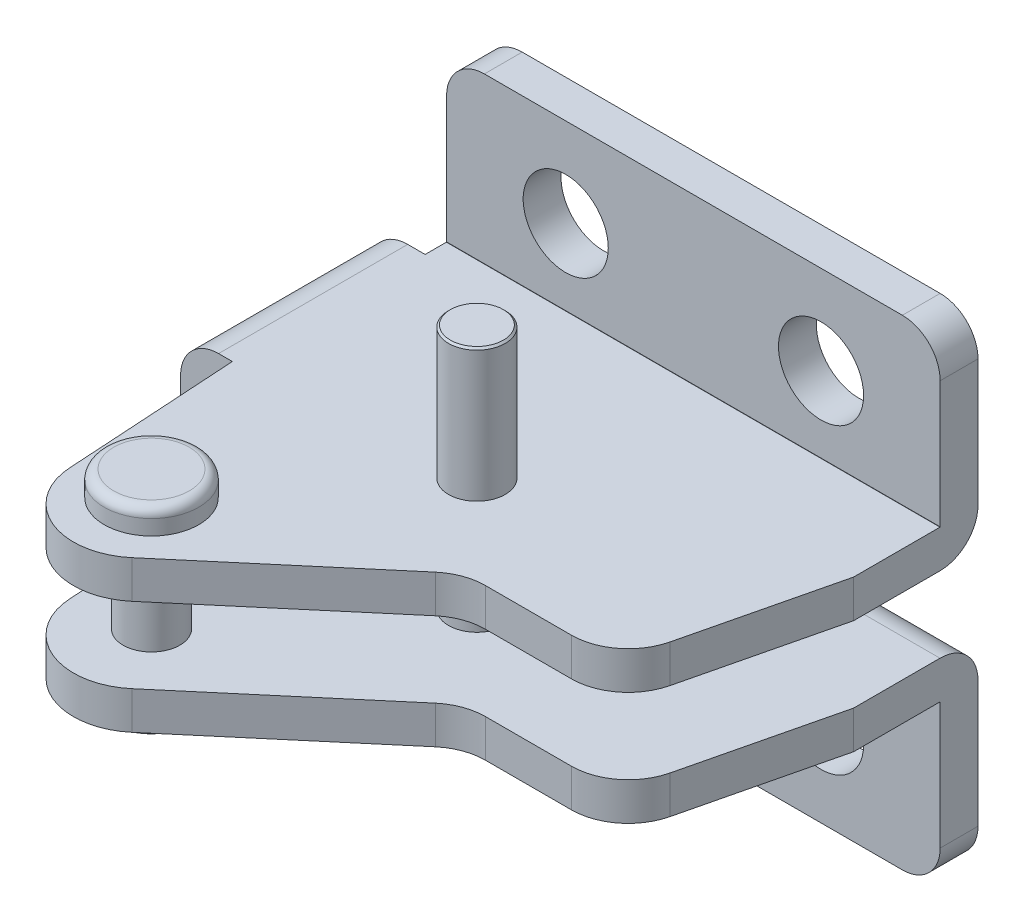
ISO-10303-21;
HEADER;
FILE_DESCRIPTION(('STEP AP214'),'2;1');
FILE_NAME('part.step','',(''),(''),'','','');
FILE_SCHEMA(('AUTOMOTIVE_DESIGN { 1 0 10303 214 1 1 1 1 }'));
ENDSEC;
DATA;
#1=APPLICATION_CONTEXT('core data for automotive mechanical design processes');
#2=APPLICATION_PROTOCOL_DEFINITION('international standard','automotive_design',2000,#1);
#3=PRODUCT_CONTEXT('',#1,'mechanical');
#4=PRODUCT('Part','Part','',(#3));
#5=PRODUCT_RELATED_PRODUCT_CATEGORY('part','',(#4));
#6=PRODUCT_DEFINITION_FORMATION('','',#4);
#7=PRODUCT_DEFINITION_CONTEXT('part definition',#1,'design');
#8=PRODUCT_DEFINITION('design','',#6,#7);
#9=PRODUCT_DEFINITION_SHAPE('','',#8);
#10=(LENGTH_UNIT() NAMED_UNIT(*) SI_UNIT(.MILLI.,.METRE.));
#11=(NAMED_UNIT(*) PLANE_ANGLE_UNIT() SI_UNIT($,.RADIAN.));
#12=(NAMED_UNIT(*) SI_UNIT($,.STERADIAN.) SOLID_ANGLE_UNIT());
#13=UNCERTAINTY_MEASURE_WITH_UNIT(LENGTH_MEASURE(1.E-05),#10,'distance_accuracy_value','');
#14=(GEOMETRIC_REPRESENTATION_CONTEXT(3) GLOBAL_UNCERTAINTY_ASSIGNED_CONTEXT((#13)) GLOBAL_UNIT_ASSIGNED_CONTEXT((#10,
#11,#12)) REPRESENTATION_CONTEXT('',''));
#15=CARTESIAN_POINT('',(0.,0.,0.));
#16=DIRECTION('',(0.,0.,1.));
#17=DIRECTION('',(1.,0.,0.));
#18=AXIS2_PLACEMENT_3D('',#15,#16,#17);
#19=CARTESIAN_POINT('',(14.9808750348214,4.00000000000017,13.7900000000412));
#20=DIRECTION('',(0.,1.,0.));
#21=DIRECTION('',(-1.,0.,-6.95098676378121E-12));
#22=AXIS2_PLACEMENT_3D('',#19,#20,#21);
#23=PLANE('',#22);
#24=DIRECTION('',(-0.23371393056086,0.,0.972305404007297));
#25=VECTOR('',#24,1.);
#26=CARTESIAN_POINT('',(19.7999999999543,4.00000000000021,6.57750204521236));
#27=LINE('',#26,#25);
#28=CARTESIAN_POINT('',(19.7999999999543,4.00000000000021,6.57750204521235));
#29=VERTEX_POINT('',#28);
#30=CARTESIAN_POINT('',(17.9194246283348,4.00000000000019,14.4011417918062));
#31=VERTEX_POINT('',#30);
#32=EDGE_CURVE('E310',#29,#31,#27,.T.);
#33=ORIENTED_EDGE('',*,*,#32,.T.);
#34=CARTESIAN_POINT('',(15.002508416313,4.00000000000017,13.7000000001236));
#35=DIRECTION('',(0.,1.,0.));
#36=DIRECTION('',(1.,0.,0.));
#37=AXIS2_PLACEMENT_3D('',#34,#35,#36);
#38=CIRCLE('',#37,3.);
#39=CARTESIAN_POINT('',(15.002508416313,4.00000000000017,16.7000000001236));
#40=VERTEX_POINT('',#39);
#41=EDGE_CURVE('E321',#40,#31,#38,.T.);
#42=ORIENTED_EDGE('',*,*,#41,.F.);
#43=DIRECTION('',(1.,0.,0.));
#44=VECTOR('',#43,1.);
#45=CARTESIAN_POINT('',(15.002508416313,4.00000000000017,16.7000000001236));
#46=LINE('',#45,#44);
#47=CARTESIAN_POINT('',(10.4534093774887,4.00000000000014,16.7000000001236));
#48=VERTEX_POINT('',#47);
#49=EDGE_CURVE('E327',#48,#40,#46,.T.);
#50=ORIENTED_EDGE('',*,*,#49,.F.);
#51=CARTESIAN_POINT('',(10.4534093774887,4.00000000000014,19.7000000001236));
#52=DIRECTION('',(0.,-1.,0.));
#53=DIRECTION('',(1.,0.,0.));
#54=AXIS2_PLACEMENT_3D('',#51,#52,#53);
#55=CIRCLE('',#54,3.);
#56=CARTESIAN_POINT('',(8.51375891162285,4.00000000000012,17.4113855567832));
#57=VERTEX_POINT('',#56);
#58=EDGE_CURVE('E316',#57,#48,#55,.T.);
#59=ORIENTED_EDGE('',*,*,#58,.F.);
#60=DIRECTION('',(-0.762871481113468,0.,0.646550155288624));
#61=VECTOR('',#60,1.);
#62=CARTESIAN_POINT('',(8.40756694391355,4.00000000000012,17.5013855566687));
#63=LINE('',#62,#61);
#64=CARTESIAN_POINT('',(-0.168808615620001,4.00000000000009,24.7700501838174));
#65=VERTEX_POINT('',#64);
#66=EDGE_CURVE('E301',#57,#65,#63,.T.);
#67=ORIENTED_EDGE('',*,*,#66,.T.);
#68=CARTESIAN_POINT('',(-2.4317341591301,4.,22.0999999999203));
#69=DIRECTION('',(0.,-1.,0.));
#70=DIRECTION('',(1.,0.,6.95098676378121E-12));
#71=AXIS2_PLACEMENT_3D('',#68,#69,#70);
#72=CIRCLE('',#71,3.49999999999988);
#73=CARTESIAN_POINT('',(-5.92504026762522,4.,22.3163618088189));
#74=VERTEX_POINT('',#73);
#75=EDGE_CURVE('E509',#74,#65,#72,.F.);
#76=ORIENTED_EDGE('',*,*,#75,.F.);
#77=DIRECTION('',(-0.0618176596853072,0.,-0.998087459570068));
#78=VECTOR('',#77,1.);
#79=CARTESIAN_POINT('',(-6.43568394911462,4.,14.0716780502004));
#80=LINE('',#79,#78);
#81=CARTESIAN_POINT('',(-6.49379131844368,4.,13.1334957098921));
#82=VERTEX_POINT('',#81);
#83=EDGE_CURVE('E512',#74,#82,#80,.T.);
#84=ORIENTED_EDGE('',*,*,#83,.T.);
#85=DIRECTION('',(-1.,0.,-6.93971474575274E-12));
#86=VECTOR('',#85,1.);
#87=CARTESIAN_POINT('',(14.980875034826,4.00000000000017,13.1334957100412));
#88=LINE('',#87,#86);
#89=CARTESIAN_POINT('',(-7.22264511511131,4.,13.1334957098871));
#90=VERTEX_POINT('',#89);
#91=EDGE_CURVE('E858',#90,#82,#88,.F.);
#92=ORIENTED_EDGE('',*,*,#91,.F.);
#93=DIRECTION('',(-6.95098676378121E-12,0.,1.));
#94=VECTOR('',#93,1.);
#95=CARTESIAN_POINT('',(-7.22264511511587,4.,13.7899999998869));
#96=LINE('',#95,#94);
#97=CARTESIAN_POINT('',(-7.2226451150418,4.,3.13349570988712));
#98=VERTEX_POINT('',#97);
#99=EDGE_CURVE('E521',#98,#90,#96,.T.);
#100=ORIENTED_EDGE('',*,*,#99,.F.);
#101=DIRECTION('',(-1.,0.,-6.93971474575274E-12));
#102=VECTOR('',#101,1.);
#103=CARTESIAN_POINT('',(-7.2326451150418,4.,3.13349570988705));
#104=LINE('',#103,#102);
#105=CARTESIAN_POINT('',(-6.30000000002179,4.,3.13349570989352));
#106=VERTEX_POINT('',#105);
#107=EDGE_CURVE('E1030',#98,#106,#104,.F.);
#108=ORIENTED_EDGE('',*,*,#107,.T.);
#109=DIRECTION('',(-6.94408239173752E-12,0.,1.));
#110=VECTOR('',#109,1.);
#111=CARTESIAN_POINT('',(-6.30000000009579,4.,13.7899999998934));
#112=LINE('',#111,#110);
#113=CARTESIAN_POINT('',(-6.30000000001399,4.,2.00999999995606));
#114=VERTEX_POINT('',#113);
#115=EDGE_CURVE('E1027',#114,#106,#112,.T.);
#116=ORIENTED_EDGE('',*,*,#115,.F.);
#117=DIRECTION('',(-1.,0.,-6.95098676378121E-12));
#118=VECTOR('',#117,1.);
#119=CARTESIAN_POINT('',(14.9808750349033,4.00000000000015,2.01000000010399));
#120=LINE('',#119,#118);
#121=CARTESIAN_POINT('',(19.799999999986,4.0000000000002,2.01000000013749));
#122=VERTEX_POINT('',#121);
#123=EDGE_CURVE('E974',#122,#114,#120,.T.);
#124=ORIENTED_EDGE('',*,*,#123,.F.);
#125=DIRECTION('',(-6.93971474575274E-12,0.,1.));
#126=VECTOR('',#125,1.);
#127=CARTESIAN_POINT('',(19.7999999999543,4.00000000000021,6.57750204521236));
#128=LINE('',#127,#126);
#129=EDGE_CURVE('E959',#122,#29,#128,.T.);
#130=ORIENTED_EDGE('',*,*,#129,.T.);
#131=EDGE_LOOP('',(#33,#42,#50,#59,#67,#76,#84,#92,#100,#108,#116,#124,#130));
#132=FACE_BOUND('',#131,.T.);
#133=CARTESIAN_POINT('',(-2.38976150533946,4.00000000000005,21.5126528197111));
#134=DIRECTION('',(0.,1.,0.));
#135=DIRECTION('',(-1.,0.,0.));
#136=AXIS2_PLACEMENT_3D('',#133,#134,#135);
#137=CIRCLE('',#136,2.5);
#138=CARTESIAN_POINT('',(-4.88976150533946,4.00000000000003,21.5126528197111));
#139=VERTEX_POINT('',#138);
#140=EDGE_CURVE('E10',#139,#139,#137,.T.);
#141=ORIENTED_EDGE('',*,*,#140,.T.);
#142=EDGE_LOOP('',(#141));
#143=FACE_BOUND('',#142,.T.);
#144=ADVANCED_FACE('F16',(#132,#143),#23,.F.);
#145=CARTESIAN_POINT('',(-2.38976150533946,12.0174570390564,21.5126528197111));
#146=DIRECTION('',(0.,1.,0.));
#147=DIRECTION('',(-0.933181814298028,0.,-0.359404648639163));
#148=AXIS2_PLACEMENT_3D('',#145,#146,#147);
#149=CYLINDRICAL_SURFACE('',#148,2.5);
#150=CARTESIAN_POINT('',(-2.38976150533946,12.8174570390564,21.5126528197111));
#151=DIRECTION('',(0.,1.,0.));
#152=DIRECTION('',(-0.933181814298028,0.,-0.359404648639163));
#153=AXIS2_PLACEMENT_3D('',#150,#151,#152);
#154=CIRCLE('',#153,2.5);
#155=CARTESIAN_POINT('',(-4.72271604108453,12.8174570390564,20.6141411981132));
#156=VERTEX_POINT('',#155);
#157=EDGE_CURVE('E382',#156,#156,#154,.F.);
#158=ORIENTED_EDGE('',*,*,#157,.T.);
#159=EDGE_LOOP('',(#158));
#160=FACE_BOUND('',#159,.T.);
#161=CARTESIAN_POINT('',(-2.38976150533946,12.0174570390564,21.5126528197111));
#162=DIRECTION('',(0.,-1.,0.));
#163=DIRECTION('',(0.,0.,-1.));
#164=AXIS2_PLACEMENT_3D('',#161,#162,#163);
#165=CIRCLE('',#164,2.5);
#166=CARTESIAN_POINT('',(-2.38976150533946,12.0174570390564,19.0126528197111));
#167=VERTEX_POINT('',#166);
#168=EDGE_CURVE('E24',#167,#167,#165,.F.);
#169=ORIENTED_EDGE('',*,*,#168,.T.);
#170=EDGE_LOOP('',(#169));
#171=FACE_BOUND('',#170,.T.);
#172=ADVANCED_FACE('F636',(#160,#171),#149,.T.);
#173=CARTESIAN_POINT('',(-2.38976150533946,13.3174570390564,21.5126528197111));
#174=DIRECTION('',(0.,-1.,0.));
#175=DIRECTION('',(0.933181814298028,0.,0.359404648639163));
#176=AXIS2_PLACEMENT_3D('',#173,#174,#175);
#177=PLANE('',#176);
#178=CARTESIAN_POINT('',(-2.38976150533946,13.3174570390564,21.5126528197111));
#179=DIRECTION('',(0.,-1.,0.));
#180=DIRECTION('',(0.933181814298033,0.,0.359404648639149));
#181=AXIS2_PLACEMENT_3D('',#178,#179,#180);
#182=CIRCLE('',#181,1.99999999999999);
#183=CARTESIAN_POINT('',(-0.5233978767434,13.3174570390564,22.2314621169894));
#184=VERTEX_POINT('',#183);
#185=CARTESIAN_POINT('',(-4.25612513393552,13.3174570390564,20.7938435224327));
#186=VERTEX_POINT('',#185);
#187=EDGE_CURVE('E1108',#184,#186,#182,.T.);
#188=ORIENTED_EDGE('',*,*,#187,.F.);
#189=CARTESIAN_POINT('',(-2.38976150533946,13.3174570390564,21.5126528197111));
#190=DIRECTION('',(0.,-1.,0.));
#191=DIRECTION('',(-0.933181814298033,0.,-0.359404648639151));
#192=AXIS2_PLACEMENT_3D('',#189,#190,#191);
#193=CIRCLE('',#192,1.99999999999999);
#194=EDGE_CURVE('E1131',#186,#184,#193,.T.);
#195=ORIENTED_EDGE('',*,*,#194,.F.);
#196=EDGE_LOOP('',(#188,#195));
#197=FACE_BOUND('',#196,.T.);
#198=ADVANCED_FACE('F391',(#197),#177,.F.);
#199=CARTESIAN_POINT('',(-2.38976150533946,12.8174570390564,21.5126528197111));
#200=DIRECTION('',(0.,-1.,0.));
#201=DIRECTION('',(0.933181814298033,0.,0.35940464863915));
#202=AXIS2_PLACEMENT_3D('',#199,#200,#201);
#203=TOROIDAL_SURFACE('',#202,1.99999999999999,0.5);
#204=ORIENTED_EDGE('',*,*,#187,.T.);
#205=ORIENTED_EDGE('',*,*,#194,.T.);
#206=EDGE_LOOP('',(#204,#205));
#207=FACE_BOUND('',#206,.T.);
#208=ORIENTED_EDGE('',*,*,#157,.F.);
#209=EDGE_LOOP('',(#208));
#210=FACE_BOUND('',#209,.T.);
#211=ADVANCED_FACE('F385',(#207,#210),#203,.T.);
#212=CARTESIAN_POINT('',(19.7999999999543,10.,6.57750204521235));
#213=DIRECTION('',(-0.972305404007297,0.,-0.23371393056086));
#214=DIRECTION('',(-0.23371393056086,0.,0.972305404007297));
#215=AXIS2_PLACEMENT_3D('',#212,#213,#214);
#216=PLANE('',#215);
#217=DIRECTION('',(0.,-1.,0.));
#218=VECTOR('',#217,1.);
#219=CARTESIAN_POINT('',(17.9194246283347,20.7000000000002,14.4011417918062));
#220=LINE('',#219,#218);
#221=CARTESIAN_POINT('',(17.9194246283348,12.,14.4011417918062));
#222=VERTEX_POINT('',#221);
#223=CARTESIAN_POINT('',(17.9194246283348,10.,14.4011417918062));
#224=VERTEX_POINT('',#223);
#225=EDGE_CURVE('E335',#222,#224,#220,.T.);
#226=ORIENTED_EDGE('',*,*,#225,.T.);
#227=DIRECTION('',(-0.23371393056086,0.,0.972305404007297));
#228=VECTOR('',#227,1.);
#229=CARTESIAN_POINT('',(19.7999999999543,10.,6.57750204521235));
#230=LINE('',#229,#228);
#231=CARTESIAN_POINT('',(19.7999999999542,10.,6.57750204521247));
#232=VERTEX_POINT('',#231);
#233=EDGE_CURVE('E788',#232,#224,#230,.T.);
#234=ORIENTED_EDGE('',*,*,#233,.F.);
#235=DIRECTION('',(0.,1.,0.));
#236=VECTOR('',#235,1.);
#237=CARTESIAN_POINT('',(19.7999999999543,10.,6.57750204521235));
#238=LINE('',#237,#236);
#239=CARTESIAN_POINT('',(19.7999999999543,12.,6.57750204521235));
#240=VERTEX_POINT('',#239);
#241=EDGE_CURVE('E453',#240,#232,#238,.F.);
#242=ORIENTED_EDGE('',*,*,#241,.F.);
#243=DIRECTION('',(-0.23371393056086,0.,0.972305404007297));
#244=VECTOR('',#243,1.);
#245=CARTESIAN_POINT('',(19.7999999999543,12.,6.57750204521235));
#246=LINE('',#245,#244);
#247=EDGE_CURVE('E449',#222,#240,#246,.F.);
#248=ORIENTED_EDGE('',*,*,#247,.F.);
#249=EDGE_LOOP('',(#226,#234,#242,#248));
#250=FACE_BOUND('',#249,.T.);
#251=ADVANCED_FACE('F390',(#250),#216,.F.);
#252=CARTESIAN_POINT('',(19.7999999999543,6.00000000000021,6.57750204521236));
#253=DIRECTION('',(-0.972305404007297,0.,-0.23371393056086));
#254=DIRECTION('',(-0.23371393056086,0.,0.972305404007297));
#255=AXIS2_PLACEMENT_3D('',#252,#253,#254);
#256=PLANE('',#255);
#257=CARTESIAN_POINT('',(17.9194246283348,6.00000000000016,14.4011417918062));
#258=VERTEX_POINT('',#257);
#259=EDGE_CURVE('E332',#258,#31,#220,.T.);
#260=ORIENTED_EDGE('',*,*,#259,.T.);
#261=ORIENTED_EDGE('',*,*,#32,.F.);
#262=DIRECTION('',(0.,1.,0.));
#263=VECTOR('',#262,1.);
#264=CARTESIAN_POINT('',(19.7999999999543,6.00000000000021,6.57750204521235));
#265=LINE('',#264,#263);
#266=CARTESIAN_POINT('',(19.7999999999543,6.00000000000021,6.57750204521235));
#267=VERTEX_POINT('',#266);
#268=EDGE_CURVE('E966',#29,#267,#265,.T.);
#269=ORIENTED_EDGE('',*,*,#268,.T.);
#270=DIRECTION('',(0.23371393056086,0.,-0.972305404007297));
#271=VECTOR('',#270,1.);
#272=CARTESIAN_POINT('',(17.8977912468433,6.0000000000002,14.4911417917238));
#273=LINE('',#272,#271);
#274=EDGE_CURVE('E438',#258,#267,#273,.T.);
#275=ORIENTED_EDGE('',*,*,#274,.F.);
#276=EDGE_LOOP('',(#260,#261,#269,#275));
#277=FACE_BOUND('',#276,.T.);
#278=ADVANCED_FACE('F729',(#277),#256,.F.);
#279=CARTESIAN_POINT('',(5.31017813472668,19.0174570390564,12.0069472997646));
#280=DIRECTION('',(0.,-1.,0.));
#281=DIRECTION('',(0.236097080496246,0.,-0.971729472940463));
#282=AXIS2_PLACEMENT_3D('',#279,#280,#281);
#283=CYLINDRICAL_SURFACE('',#282,1.5);
#284=CARTESIAN_POINT('',(5.31017813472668,6.00000000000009,12.0069472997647));
#285=DIRECTION('',(0.,1.,0.));
#286=DIRECTION('',(-1.,0.,0.));
#287=AXIS2_PLACEMENT_3D('',#284,#285,#286);
#288=CIRCLE('',#287,1.5);
#289=CARTESIAN_POINT('',(3.81017813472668,6.00000000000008,12.0069472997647));
#290=VERTEX_POINT('',#289);
#291=EDGE_CURVE('E367',#290,#290,#288,.F.);
#292=ORIENTED_EDGE('',*,*,#291,.F.);
#293=EDGE_LOOP('',(#292));
#294=FACE_BOUND('',#293,.T.);
#295=CARTESIAN_POINT('',(5.31017813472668,10.,12.0069472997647));
#296=DIRECTION('',(0.,-1.,0.));
#297=DIRECTION('',(1.,0.,0.));
#298=AXIS2_PLACEMENT_3D('',#295,#296,#297);
#299=CIRCLE('',#298,1.5);
#300=CARTESIAN_POINT('',(6.81017813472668,10.,12.0069472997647));
#301=VERTEX_POINT('',#300);
#302=EDGE_CURVE('E371',#301,#301,#299,.F.);
#303=ORIENTED_EDGE('',*,*,#302,.F.);
#304=EDGE_LOOP('',(#303));
#305=FACE_BOUND('',#304,.T.);
#306=ADVANCED_FACE('F700',(#294,#305),#283,.T.);
#307=CARTESIAN_POINT('',(-1.38899308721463E-11,0.,2.));
#308=DIRECTION('',(-6.94400379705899E-12,0.,1.));
#309=DIRECTION('',(1.,0.,6.94400379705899E-12));
#310=AXIS2_PLACEMENT_3D('',#307,#308,#309);
#311=CYLINDRICAL_SURFACE('',#310,2.25);
#312=CARTESIAN_POINT('',(0.,0.,0.));
#313=DIRECTION('',(-6.94400379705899E-12,0.,1.));
#314=DIRECTION('',(1.,0.,6.94400379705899E-12));
#315=AXIS2_PLACEMENT_3D('',#312,#313,#314);
#316=CIRCLE('',#315,2.25);
#317=CARTESIAN_POINT('',(2.25,0.,1.56235748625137E-11));
#318=VERTEX_POINT('',#317);
#319=EDGE_CURVE('E536',#318,#318,#316,.T.);
#320=ORIENTED_EDGE('',*,*,#319,.F.);
#321=EDGE_LOOP('',(#320));
#322=FACE_BOUND('',#321,.T.);
#323=CARTESIAN_POINT('',(-1.38899308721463E-11,0.,2.));
#324=DIRECTION('',(-6.94400379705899E-12,0.,1.));
#325=DIRECTION('',(1.,0.,6.94400379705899E-12));
#326=AXIS2_PLACEMENT_3D('',#323,#324,#325);
#327=CIRCLE('',#326,2.25);
#328=CARTESIAN_POINT('',(2.24999999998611,0.,2.00000000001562));
#329=VERTEX_POINT('',#328);
#330=EDGE_CURVE('E569',#329,#329,#327,.F.);
#331=ORIENTED_EDGE('',*,*,#330,.F.);
#332=EDGE_LOOP('',(#331));
#333=FACE_BOUND('',#332,.T.);
#334=ADVANCED_FACE('F696',(#322,#333),#311,.F.);
#335=CARTESIAN_POINT('',(13.4999999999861,1.04083408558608E-13,2.00000000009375));
#336=DIRECTION('',(-6.94400379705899E-12,0.,1.));
#337=DIRECTION('',(1.,0.,6.94400379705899E-12));
#338=AXIS2_PLACEMENT_3D('',#335,#336,#337);
#339=CYLINDRICAL_SURFACE('',#338,2.25);
#340=CARTESIAN_POINT('',(13.5,1.00613961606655E-13,9.3754648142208E-11));
#341=DIRECTION('',(-6.94400379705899E-12,0.,1.));
#342=DIRECTION('',(1.,0.,6.94400379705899E-12));
#343=AXIS2_PLACEMENT_3D('',#340,#341,#342);
#344=CIRCLE('',#343,2.25);
#345=CARTESIAN_POINT('',(15.75,1.16146761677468E-13,1.09378656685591E-10));
#346=VERTEX_POINT('',#345);
#347=EDGE_CURVE('E532',#346,#346,#344,.T.);
#348=ORIENTED_EDGE('',*,*,#347,.F.);
#349=EDGE_LOOP('',(#348));
#350=FACE_BOUND('',#349,.T.);
#351=CARTESIAN_POINT('',(13.4999999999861,1.04083408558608E-13,2.00000000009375));
#352=DIRECTION('',(-6.94400379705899E-12,0.,1.));
#353=DIRECTION('',(1.,0.,6.94400379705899E-12));
#354=AXIS2_PLACEMENT_3D('',#351,#352,#353);
#355=CIRCLE('',#354,2.25);
#356=CARTESIAN_POINT('',(15.7499999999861,1.19616208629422E-13,2.00000000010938));
#357=VERTEX_POINT('',#356);
#358=EDGE_CURVE('E566',#357,#357,#355,.F.);
#359=ORIENTED_EDGE('',*,*,#358,.F.);
#360=EDGE_LOOP('',(#359));
#361=FACE_BOUND('',#360,.T.);
#362=ADVANCED_FACE('F689',(#350,#361),#339,.F.);
#363=CARTESIAN_POINT('',(17.8,-4.6999999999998,1.23631790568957E-10));
#364=DIRECTION('',(0.,1.,0.));
#365=DIRECTION('',(-1.,0.,-6.95098676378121E-12));
#366=AXIS2_PLACEMENT_3D('',#363,#364,#365);
#367=PLANE('',#366);
#368=DIRECTION('',(-6.94400380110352E-12,0.,1.));
#369=VECTOR('',#368,1.);
#370=CARTESIAN_POINT('',(-4.3,-4.6999999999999,-2.98331238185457E-11));
#371=LINE('',#370,#369);
#372=CARTESIAN_POINT('',(-4.3,-4.6999999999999,-2.98331238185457E-11));
#373=VERTEX_POINT('',#372);
#374=CARTESIAN_POINT('',(-4.30000000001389,-4.6999999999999,1.99999999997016));
#375=VERTEX_POINT('',#374);
#376=EDGE_CURVE('E556',#373,#375,#371,.T.);
#377=ORIENTED_EDGE('',*,*,#376,.F.);
#378=DIRECTION('',(-1.,0.,-6.94400380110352E-12));
#379=VECTOR('',#378,1.);
#380=CARTESIAN_POINT('',(14.9808750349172,-4.69999999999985,1.04051749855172E-10));
#381=LINE('',#380,#379);
#382=CARTESIAN_POINT('',(17.8,-4.6999999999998,1.23631790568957E-10));
#383=VERTEX_POINT('',#382);
#384=EDGE_CURVE('E527',#383,#373,#381,.T.);
#385=ORIENTED_EDGE('',*,*,#384,.F.);
#386=DIRECTION('',(-6.95098676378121E-12,0.,1.));
#387=VECTOR('',#386,1.);
#388=CARTESIAN_POINT('',(17.8,-4.6999999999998,1.23631790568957E-10));
#389=LINE('',#388,#387);
#390=CARTESIAN_POINT('',(17.7999999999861,-4.6999999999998,2.00000000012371));
#391=VERTEX_POINT('',#390);
#392=EDGE_CURVE('E564',#391,#383,#389,.F.);
#393=ORIENTED_EDGE('',*,*,#392,.F.);
#394=DIRECTION('',(-1.,0.,-6.95098676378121E-12));
#395=VECTOR('',#394,1.);
#396=CARTESIAN_POINT('',(17.7999999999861,-4.6999999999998,2.00000000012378));
#397=LINE('',#396,#395);
#398=EDGE_CURVE('E561',#375,#391,#397,.F.);
#399=ORIENTED_EDGE('',*,*,#398,.F.);
#400=EDGE_LOOP('',(#377,#385,#393,#399));
#401=FACE_BOUND('',#400,.T.);
#402=ADVANCED_FACE('F630',(#401),#367,.F.);
#403=CARTESIAN_POINT('',(-4.3,-2.6999999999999,-2.9841146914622E-11));
#404=DIRECTION('',(-6.94400380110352E-12,0.,1.));
#405=DIRECTION('',(1.,0.,6.94400380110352E-12));
#406=AXIS2_PLACEMENT_3D('',#403,#404,#405);
#407=CYLINDRICAL_SURFACE('',#406,2.);
#408=CARTESIAN_POINT('',(-4.3,-2.6999999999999,-2.9841146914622E-11));
#409=DIRECTION('',(-6.94400380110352E-12,0.,1.));
#410=DIRECTION('',(1.,0.,6.94400380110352E-12));
#411=AXIS2_PLACEMENT_3D('',#408,#409,#410);
#412=CIRCLE('',#411,2.);
#413=CARTESIAN_POINT('',(-6.3,-2.6999999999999,-4.37263072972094E-11));
#414=VERTEX_POINT('',#413);
#415=EDGE_CURVE('E523',#373,#414,#412,.F.);
#416=ORIENTED_EDGE('',*,*,#415,.F.);
#417=ORIENTED_EDGE('',*,*,#376,.T.);
#418=CARTESIAN_POINT('',(-4.3000000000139,-2.69999999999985,1.99999999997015));
#419=DIRECTION('',(-6.94400380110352E-12,0.,1.));
#420=DIRECTION('',(1.,0.,6.94400380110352E-12));
#421=AXIS2_PLACEMENT_3D('',#418,#419,#420);
#422=CIRCLE('',#421,2.);
#423=CARTESIAN_POINT('',(-6.3000000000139,-2.6999999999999,1.99999999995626));
#424=VERTEX_POINT('',#423);
#425=EDGE_CURVE('E557',#375,#424,#422,.F.);
#426=ORIENTED_EDGE('',*,*,#425,.T.);
#427=DIRECTION('',(-6.94400380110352E-12,0.,1.));
#428=VECTOR('',#427,1.);
#429=CARTESIAN_POINT('',(-6.3,-2.6999999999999,-4.37263072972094E-11));
#430=LINE('',#429,#428);
#431=EDGE_CURVE('E560',#424,#414,#430,.F.);
#432=ORIENTED_EDGE('',*,*,#431,.T.);
#433=EDGE_LOOP('',(#416,#417,#426,#432));
#434=FACE_BOUND('',#433,.T.);
#435=ADVANCED_FACE('F618',(#434),#407,.T.);
#436=CARTESIAN_POINT('',(-1.40096267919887E-11,16.,1.99999999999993));
#437=DIRECTION('',(-6.94400379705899E-12,0.,1.));
#438=DIRECTION('',(1.,0.,6.94400379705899E-12));
#439=AXIS2_PLACEMENT_3D('',#436,#437,#438);
#440=CYLINDRICAL_SURFACE('',#439,2.25);
#441=CARTESIAN_POINT('',(-1.196959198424E-13,16.,0.));
#442=DIRECTION('',(-6.94400379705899E-12,0.,1.));
#443=DIRECTION('',(1.,0.,6.94400379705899E-12));
#444=AXIS2_PLACEMENT_3D('',#441,#442,#443);
#445=CIRCLE('',#444,2.25);
#446=CARTESIAN_POINT('',(2.24999999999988,16.,1.5714864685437E-11));
#447=VERTEX_POINT('',#446);
#448=EDGE_CURVE('E599',#447,#447,#445,.T.);
#449=ORIENTED_EDGE('',*,*,#448,.F.);
#450=EDGE_LOOP('',(#449));
#451=FACE_BOUND('',#450,.T.);
#452=CARTESIAN_POINT('',(-1.40096267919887E-11,16.,1.99999999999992));
#453=DIRECTION('',(-6.94400379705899E-12,0.,1.));
#454=DIRECTION('',(1.,0.,6.94400379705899E-12));
#455=AXIS2_PLACEMENT_3D('',#452,#453,#454);
#456=CIRCLE('',#455,2.25);
#457=CARTESIAN_POINT('',(2.24999999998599,16.,2.00000000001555));
#458=VERTEX_POINT('',#457);
#459=EDGE_CURVE('E360',#458,#458,#456,.F.);
#460=ORIENTED_EDGE('',*,*,#459,.F.);
#461=EDGE_LOOP('',(#460));
#462=FACE_BOUND('',#461,.T.);
#463=ADVANCED_FACE('F615',(#451,#462),#440,.F.);
#464=CARTESIAN_POINT('',(13.499999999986,16.,2.00000000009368));
#465=DIRECTION('',(-6.94400379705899E-12,0.,1.));
#466=DIRECTION('',(1.,0.,6.94400379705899E-12));
#467=AXIS2_PLACEMENT_3D('',#464,#465,#466);
#468=CYLINDRICAL_SURFACE('',#467,2.25);
#469=CARTESIAN_POINT('',(13.5,16.,9.37756816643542E-11));
#470=DIRECTION('',(-6.94400379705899E-12,0.,1.));
#471=DIRECTION('',(1.,0.,6.94400379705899E-12));
#472=AXIS2_PLACEMENT_3D('',#469,#470,#471);
#473=CIRCLE('',#472,2.25);
#474=CARTESIAN_POINT('',(15.75,16.,1.09399690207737E-10));
#475=VERTEX_POINT('',#474);
#476=EDGE_CURVE('E480',#475,#475,#473,.T.);
#477=ORIENTED_EDGE('',*,*,#476,.F.);
#478=EDGE_LOOP('',(#477));
#479=FACE_BOUND('',#478,.T.);
#480=CARTESIAN_POINT('',(13.499999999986,16.,2.00000000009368));
#481=DIRECTION('',(-6.94400379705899E-12,0.,1.));
#482=DIRECTION('',(1.,0.,6.94400379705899E-12));
#483=AXIS2_PLACEMENT_3D('',#480,#481,#482);
#484=CIRCLE('',#483,2.25);
#485=CARTESIAN_POINT('',(15.749999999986,16.,2.0000000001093));
#486=VERTEX_POINT('',#485);
#487=EDGE_CURVE('E502',#486,#486,#484,.F.);
#488=ORIENTED_EDGE('',*,*,#487,.F.);
#489=EDGE_LOOP('',(#488));
#490=FACE_BOUND('',#489,.T.);
#491=ADVANCED_FACE('F617',(#479,#490),#468,.F.);
#492=CARTESIAN_POINT('',(-4.30000000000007,20.7,-2.97411834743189E-11));
#493=DIRECTION('',(0.,-1.,0.));
#494=DIRECTION('',(1.,0.,6.95098676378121E-12));
#495=AXIS2_PLACEMENT_3D('',#492,#493,#494);
#496=PLANE('',#495);
#497=DIRECTION('',(-6.93971474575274E-12,0.,1.));
#498=VECTOR('',#497,1.);
#499=CARTESIAN_POINT('',(17.8,20.7,1.23628754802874E-10));
#500=LINE('',#499,#498);
#501=CARTESIAN_POINT('',(17.8,20.7,1.23628754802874E-10));
#502=VERTEX_POINT('',#501);
#503=CARTESIAN_POINT('',(17.799999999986,20.7,2.00000000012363));
#504=VERTEX_POINT('',#503);
#505=EDGE_CURVE('E488',#502,#504,#500,.T.);
#506=ORIENTED_EDGE('',*,*,#505,.F.);
#507=DIRECTION('',(-1.,0.,-6.93971474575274E-12));
#508=VECTOR('',#507,1.);
#509=CARTESIAN_POINT('',(-36.5791738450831,20.7,-2.53741255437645E-10));
#510=LINE('',#509,#508);
#511=CARTESIAN_POINT('',(-4.30000000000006,20.7,-2.97411834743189E-11));
#512=VERTEX_POINT('',#511);
#513=EDGE_CURVE('E470',#512,#502,#510,.F.);
#514=ORIENTED_EDGE('',*,*,#513,.F.);
#515=DIRECTION('',(-6.95098676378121E-12,0.,1.));
#516=VECTOR('',#515,1.);
#517=CARTESIAN_POINT('',(-4.30000000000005,20.7,-2.97411834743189E-11));
#518=LINE('',#517,#516);
#519=CARTESIAN_POINT('',(-4.30000000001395,20.7,1.99999999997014));
#520=VERTEX_POINT('',#519);
#521=EDGE_CURVE('E492',#520,#512,#518,.F.);
#522=ORIENTED_EDGE('',*,*,#521,.F.);
#523=DIRECTION('',(1.,0.,6.95098676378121E-12));
#524=VECTOR('',#523,1.);
#525=CARTESIAN_POINT('',(-4.30000000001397,20.7,1.99999999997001));
#526=LINE('',#525,#524);
#527=EDGE_CURVE('E494',#504,#520,#526,.F.);
#528=ORIENTED_EDGE('',*,*,#527,.F.);
#529=EDGE_LOOP('',(#506,#514,#522,#528));
#530=FACE_BOUND('',#529,.T.);
#531=ADVANCED_FACE('F627',(#530),#496,.F.);
#532=CARTESIAN_POINT('',(-4.30000000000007,18.7,-2.97431350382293E-11));
#533=DIRECTION('',(-6.93971474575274E-12,0.,1.));
#534=DIRECTION('',(1.,0.,6.93971474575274E-12));
#535=AXIS2_PLACEMENT_3D('',#532,#533,#534);
#536=CYLINDRICAL_SURFACE('',#535,2.);
#537=CARTESIAN_POINT('',(-4.30000000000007,18.7,-2.97481223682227E-11));
#538=DIRECTION('',(-6.93971474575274E-12,0.,1.));
#539=DIRECTION('',(1.,0.,6.93971474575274E-12));
#540=AXIS2_PLACEMENT_3D('',#537,#538,#539);
#541=CIRCLE('',#540,2.);
#542=CARTESIAN_POINT('',(-6.30000000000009,18.7,-4.36230912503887E-11));
#543=VERTEX_POINT('',#542);
#544=EDGE_CURVE('E474',#543,#512,#541,.F.);
#545=ORIENTED_EDGE('',*,*,#544,.F.);
#546=DIRECTION('',(-6.93971474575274E-12,0.,1.));
#547=VECTOR('',#546,1.);
#548=CARTESIAN_POINT('',(-6.30000000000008,18.7,-4.36181039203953E-11));
#549=LINE('',#548,#547);
#550=CARTESIAN_POINT('',(-6.30000000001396,18.7,1.99999999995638));
#551=VERTEX_POINT('',#550);
#552=EDGE_CURVE('E495',#543,#551,#549,.T.);
#553=ORIENTED_EDGE('',*,*,#552,.T.);
#554=CARTESIAN_POINT('',(-4.30000000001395,18.7,1.99999999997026));
#555=DIRECTION('',(-6.93971474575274E-12,0.,1.));
#556=DIRECTION('',(1.,0.,6.93971474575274E-12));
#557=AXIS2_PLACEMENT_3D('',#554,#555,#556);
#558=CIRCLE('',#557,2.);
#559=EDGE_CURVE('E498',#551,#520,#558,.F.);
#560=ORIENTED_EDGE('',*,*,#559,.T.);
#561=ORIENTED_EDGE('',*,*,#521,.T.);
#562=EDGE_LOOP('',(#545,#553,#560,#561));
#563=FACE_BOUND('',#562,.T.);
#564=ADVANCED_FACE('F707',(#563),#536,.T.);
#565=CARTESIAN_POINT('',(-9.23264511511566,-17.78002444,13.7899999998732));
#566=DIRECTION('',(1.,0.,6.93971474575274E-12));
#567=DIRECTION('',(6.93971474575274E-12,0.,-1.));
#568=AXIS2_PLACEMENT_3D('',#565,#566,#567);
#569=PLANE('',#568);
#570=DIRECTION('',(6.93971474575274E-12,0.,-1.));
#571=VECTOR('',#570,1.);
#572=CARTESIAN_POINT('',(-9.23264511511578,9.99,13.7899999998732));
#573=LINE('',#572,#571);
#574=CARTESIAN_POINT('',(-9.23264511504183,9.99,3.13349570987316));
#575=VERTEX_POINT('',#574);
#576=CARTESIAN_POINT('',(-9.23264511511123,9.99,13.1334957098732));
#577=VERTEX_POINT('',#576);
#578=EDGE_CURVE('E574',#575,#577,#573,.F.);
#579=ORIENTED_EDGE('',*,*,#578,.F.);
#580=DIRECTION('',(0.,1.,0.));
#581=VECTOR('',#580,1.);
#582=CARTESIAN_POINT('',(-9.23264511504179,5.5008505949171,3.13349570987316));
#583=LINE('',#582,#581);
#584=CARTESIAN_POINT('',(-9.2326451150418,6.01,3.13349570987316));
#585=VERTEX_POINT('',#584);
#586=EDGE_CURVE('E1004',#575,#585,#583,.F.);
#587=ORIENTED_EDGE('',*,*,#586,.T.);
#588=DIRECTION('',(6.93971474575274E-12,0.,-1.));
#589=VECTOR('',#588,1.);
#590=CARTESIAN_POINT('',(-9.2326451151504,6.01,18.7815591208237));
#591=LINE('',#590,#589);
#592=CARTESIAN_POINT('',(-9.23264511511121,6.01,13.1334957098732));
#593=VERTEX_POINT('',#592);
#594=EDGE_CURVE('E546',#593,#585,#591,.T.);
#595=ORIENTED_EDGE('',*,*,#594,.F.);
#596=DIRECTION('',(0.,1.,0.));
#597=VECTOR('',#596,1.);
#598=CARTESIAN_POINT('',(-9.2326451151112,4.63462200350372,13.1334957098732));
#599=LINE('',#598,#597);
#600=EDGE_CURVE('E549',#593,#577,#599,.T.);
#601=ORIENTED_EDGE('',*,*,#600,.T.);
#602=EDGE_LOOP('',(#579,#587,#595,#601));
#603=FACE_BOUND('',#602,.T.);
#604=ADVANCED_FACE('F684',(#603),#569,.F.);
#605=CARTESIAN_POINT('',(-6.30000000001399,3.99,2.00999999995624));
#606=DIRECTION('',(-1.,0.,-6.94408239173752E-12));
#607=DIRECTION('',(-6.94408239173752E-12,0.,1.));
#608=AXIS2_PLACEMENT_3D('',#605,#606,#607);
#609=PLANE('',#608);
#610=CARTESIAN_POINT('',(-6.30000000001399,3.99,2.00999999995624));
#611=DIRECTION('',(1.,0.,6.94400380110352E-12));
#612=DIRECTION('',(6.94400380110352E-12,0.,-1.));
#613=AXIS2_PLACEMENT_3D('',#610,#611,#612);
#614=CIRCLE('',#613,2.01);
#615=CARTESIAN_POINT('',(-6.30000000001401,6.,2.00999999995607));
#616=VERTEX_POINT('',#615);
#617=CARTESIAN_POINT('',(-6.3,3.99,-4.37612186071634E-11));
#618=VERTEX_POINT('',#617);
#619=EDGE_CURVE('E553',#616,#618,#614,.F.);
#620=ORIENTED_EDGE('',*,*,#619,.T.);
#621=DIRECTION('',(0.,1.,0.));
#622=VECTOR('',#621,1.);
#623=CARTESIAN_POINT('',(-6.30000000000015,17.35650429,-4.3831258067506E-11));
#624=LINE('',#623,#622);
#625=EDGE_CURVE('E535',#414,#618,#624,.T.);
#626=ORIENTED_EDGE('',*,*,#625,.F.);
#627=ORIENTED_EDGE('',*,*,#431,.F.);
#628=DIRECTION('',(0.,1.,0.));
#629=VECTOR('',#628,1.);
#630=CARTESIAN_POINT('',(-6.30000000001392,4.7000000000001,1.99999999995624));
#631=LINE('',#630,#629);
#632=CARTESIAN_POINT('',(-6.30000000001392,3.99,1.99999999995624));
#633=VERTEX_POINT('',#632);
#634=EDGE_CURVE('E565',#633,#424,#631,.F.);
#635=ORIENTED_EDGE('',*,*,#634,.F.);
#636=CARTESIAN_POINT('',(-6.30000000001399,3.99,2.00999999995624));
#637=DIRECTION('',(-1.,0.,-6.94408239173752E-12));
#638=DIRECTION('',(-6.94408239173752E-12,0.,1.));
#639=AXIS2_PLACEMENT_3D('',#636,#637,#638);
#640=CIRCLE('',#639,0.00999999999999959);
#641=EDGE_CURVE('E542',#633,#114,#640,.F.);
#642=ORIENTED_EDGE('',*,*,#641,.T.);
#643=ORIENTED_EDGE('',*,*,#115,.T.);
#644=DIRECTION('',(0.,1.,0.));
#645=VECTOR('',#644,1.);
#646=CARTESIAN_POINT('',(-6.30000000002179,3.99,3.13349570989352));
#647=LINE('',#646,#645);
#648=CARTESIAN_POINT('',(-6.30000000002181,6.,3.13349570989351));
#649=VERTEX_POINT('',#648);
#650=EDGE_CURVE('E1026',#649,#106,#647,.F.);
#651=ORIENTED_EDGE('',*,*,#650,.F.);
#652=DIRECTION('',(6.94408239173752E-12,0.,-1.));
#653=VECTOR('',#652,1.);
#654=CARTESIAN_POINT('',(-6.30000000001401,6.,2.00999999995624));
#655=LINE('',#654,#653);
#656=EDGE_CURVE('E448',#616,#649,#655,.F.);
#657=ORIENTED_EDGE('',*,*,#656,.F.);
#658=EDGE_LOOP('',(#620,#626,#627,#635,#642,#643,#651,#657));
#659=FACE_BOUND('',#658,.T.);
#660=ADVANCED_FACE('F657',(#659),#609,.T.);
#661=CARTESIAN_POINT('',(14.980875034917,17.3565042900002,1.03938775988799E-10));
#662=DIRECTION('',(6.94400380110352E-12,0.,-1.));
#663=DIRECTION('',(-1.,0.,-6.94400380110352E-12));
#664=AXIS2_PLACEMENT_3D('',#661,#662,#663);
#665=PLANE('',#664);
#666=ORIENTED_EDGE('',*,*,#384,.T.);
#667=ORIENTED_EDGE('',*,*,#415,.T.);
#668=ORIENTED_EDGE('',*,*,#625,.T.);
#669=DIRECTION('',(1.,0.,6.94400380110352E-12));
#670=VECTOR('',#669,1.);
#671=CARTESIAN_POINT('',(-19.6758918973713,3.98999999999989,-1.36646119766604E-10));
#672=LINE('',#671,#670);
#673=CARTESIAN_POINT('',(19.8,3.9900000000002,1.37473799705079E-10));
#674=VERTEX_POINT('',#673);
#675=EDGE_CURVE('E517',#674,#618,#672,.F.);
#676=ORIENTED_EDGE('',*,*,#675,.F.);
#677=DIRECTION('',(0.,1.,0.));
#678=VECTOR('',#677,1.);
#679=CARTESIAN_POINT('',(19.8,17.3565042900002,1.37403760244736E-10));
#680=LINE('',#679,#678);
#681=CARTESIAN_POINT('',(19.8,-2.6999999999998,1.37508711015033E-10));
#682=VERTEX_POINT('',#681);
#683=EDGE_CURVE('E531',#674,#682,#680,.F.);
#684=ORIENTED_EDGE('',*,*,#683,.T.);
#685=CARTESIAN_POINT('',(17.8,-2.6999999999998,1.2362376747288E-10));
#686=DIRECTION('',(-6.94400380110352E-12,0.,1.));
#687=DIRECTION('',(1.,0.,6.94400380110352E-12));
#688=AXIS2_PLACEMENT_3D('',#685,#686,#687);
#689=CIRCLE('',#688,2.);
#690=EDGE_CURVE('E528',#682,#383,#689,.F.);
#691=ORIENTED_EDGE('',*,*,#690,.T.);
#692=EDGE_LOOP('',(#666,#667,#668,#676,#684,#691));
#693=FACE_BOUND('',#692,.T.);
#694=ORIENTED_EDGE('',*,*,#347,.T.);
#695=EDGE_LOOP('',(#694));
#696=FACE_BOUND('',#695,.T.);
#697=ORIENTED_EDGE('',*,*,#319,.T.);
#698=EDGE_LOOP('',(#697));
#699=FACE_BOUND('',#698,.T.);
#700=ADVANCED_FACE('F653',(#693,#696,#699),#665,.T.);
#701=CARTESIAN_POINT('',(17.8,-2.6999999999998,1.2362376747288E-10));
#702=DIRECTION('',(-6.94400380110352E-12,0.,1.));
#703=DIRECTION('',(1.,0.,6.94400380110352E-12));
#704=AXIS2_PLACEMENT_3D('',#701,#702,#703);
#705=CYLINDRICAL_SURFACE('',#704,2.);
#706=ORIENTED_EDGE('',*,*,#690,.F.);
#707=DIRECTION('',(-6.94400380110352E-12,0.,1.));
#708=VECTOR('',#707,1.);
#709=CARTESIAN_POINT('',(19.8,-2.6999999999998,1.37463825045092E-10));
#710=LINE('',#709,#708);
#711=CARTESIAN_POINT('',(19.7999999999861,-2.6999999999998,2.00000000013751));
#712=VERTEX_POINT('',#711);
#713=EDGE_CURVE('E996',#682,#712,#710,.T.);
#714=ORIENTED_EDGE('',*,*,#713,.T.);
#715=CARTESIAN_POINT('',(17.7999999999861,-2.6999999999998,2.00000000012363));
#716=DIRECTION('',(-6.94400380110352E-12,0.,1.));
#717=DIRECTION('',(1.,0.,6.94400380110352E-12));
#718=AXIS2_PLACEMENT_3D('',#715,#716,#717);
#719=CIRCLE('',#718,2.);
#720=EDGE_CURVE('E562',#712,#391,#719,.F.);
#721=ORIENTED_EDGE('',*,*,#720,.T.);
#722=ORIENTED_EDGE('',*,*,#392,.T.);
#723=EDGE_LOOP('',(#706,#714,#721,#722));
#724=FACE_BOUND('',#723,.T.);
#725=ADVANCED_FACE('F656',(#724),#705,.T.);
#726=CARTESIAN_POINT('',(14.9808750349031,17.3565042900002,2.00000000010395));
#727=DIRECTION('',(6.94400380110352E-12,0.,-1.));
#728=DIRECTION('',(-1.,0.,-6.94400380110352E-12));
#729=AXIS2_PLACEMENT_3D('',#726,#727,#728);
#730=PLANE('',#729);
#731=ORIENTED_EDGE('',*,*,#634,.T.);
#732=ORIENTED_EDGE('',*,*,#425,.F.);
#733=ORIENTED_EDGE('',*,*,#398,.T.);
#734=ORIENTED_EDGE('',*,*,#720,.F.);
#735=DIRECTION('',(0.,1.,0.));
#736=VECTOR('',#735,1.);
#737=CARTESIAN_POINT('',(19.799999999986,10.1440063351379,2.00000000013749));
#738=LINE('',#737,#736);
#739=CARTESIAN_POINT('',(19.7999999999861,3.9900000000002,2.00000000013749));
#740=VERTEX_POINT('',#739);
#741=EDGE_CURVE('E994',#712,#740,#738,.T.);
#742=ORIENTED_EDGE('',*,*,#741,.T.);
#743=DIRECTION('',(-1.,0.,-6.94400380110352E-12));
#744=VECTOR('',#743,1.);
#745=CARTESIAN_POINT('',(14.9808750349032,3.99000000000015,2.00000000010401));
#746=LINE('',#745,#744);
#747=EDGE_CURVE('E539',#740,#633,#746,.T.);
#748=ORIENTED_EDGE('',*,*,#747,.T.);
#749=EDGE_LOOP('',(#731,#732,#733,#734,#742,#748));
#750=FACE_BOUND('',#749,.T.);
#751=ORIENTED_EDGE('',*,*,#358,.T.);
#752=EDGE_LOOP('',(#751));
#753=FACE_BOUND('',#752,.T.);
#754=ORIENTED_EDGE('',*,*,#330,.T.);
#755=EDGE_LOOP('',(#754));
#756=FACE_BOUND('',#755,.T.);
#757=ADVANCED_FACE('F667',(#750,#753,#756),#730,.F.);
#758=CARTESIAN_POINT('',(-7.2226451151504,6.01,18.7815591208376));
#759=DIRECTION('',(6.93971474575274E-12,0.,-1.));
#760=DIRECTION('',(-1.,0.,-6.93971474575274E-12));
#761=AXIS2_PLACEMENT_3D('',#758,#759,#760);
#762=CYLINDRICAL_SURFACE('',#761,2.01);
#763=ORIENTED_EDGE('',*,*,#99,.T.);
#764=CARTESIAN_POINT('',(-7.22264511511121,6.01,13.1334957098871));
#765=DIRECTION('',(6.93971474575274E-12,0.,-1.));
#766=DIRECTION('',(-1.,0.,-6.93971474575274E-12));
#767=AXIS2_PLACEMENT_3D('',#764,#765,#766);
#768=CIRCLE('',#767,2.01);
#769=EDGE_CURVE('E544',#90,#593,#768,.T.);
#770=ORIENTED_EDGE('',*,*,#769,.T.);
#771=ORIENTED_EDGE('',*,*,#594,.T.);
#772=CARTESIAN_POINT('',(-7.22264511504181,6.01,3.13349570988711));
#773=DIRECTION('',(6.93971474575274E-12,0.,-1.));
#774=DIRECTION('',(-1.,0.,-6.93971474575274E-12));
#775=AXIS2_PLACEMENT_3D('',#772,#773,#774);
#776=CIRCLE('',#775,2.01);
#777=EDGE_CURVE('E577',#585,#98,#776,.F.);
#778=ORIENTED_EDGE('',*,*,#777,.T.);
#779=EDGE_LOOP('',(#763,#770,#771,#778));
#780=FACE_BOUND('',#779,.T.);
#781=ADVANCED_FACE('F663',(#780),#762,.T.);
#782=CARTESIAN_POINT('',(-19.6758918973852,3.9899999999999,2.00999999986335));
#783=DIRECTION('',(1.,0.,6.94400380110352E-12));
#784=DIRECTION('',(6.94400380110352E-12,0.,-1.));
#785=AXIS2_PLACEMENT_3D('',#782,#783,#784);
#786=CYLINDRICAL_SURFACE('',#785,0.00999999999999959);
#787=CARTESIAN_POINT('',(19.799999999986,3.9900000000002,2.01000000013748));
#788=DIRECTION('',(1.,0.,6.94400380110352E-12));
#789=DIRECTION('',(6.94400380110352E-12,0.,-1.));
#790=AXIS2_PLACEMENT_3D('',#787,#788,#789);
#791=CIRCLE('',#790,0.00999999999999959);
#792=EDGE_CURVE('E518',#122,#740,#791,.F.);
#793=ORIENTED_EDGE('',*,*,#792,.F.);
#794=ORIENTED_EDGE('',*,*,#123,.T.);
#795=ORIENTED_EDGE('',*,*,#641,.F.);
#796=ORIENTED_EDGE('',*,*,#747,.F.);
#797=EDGE_LOOP('',(#793,#794,#795,#796));
#798=FACE_BOUND('',#797,.T.);
#799=ADVANCED_FACE('F659',(#798),#786,.F.);
#800=CARTESIAN_POINT('',(-7.22264511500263,9.99,-2.51456770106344));
#801=DIRECTION('',(-6.93971474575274E-12,0.,1.));
#802=DIRECTION('',(1.,0.,6.93971474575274E-12));
#803=AXIS2_PLACEMENT_3D('',#800,#801,#802);
#804=CYLINDRICAL_SURFACE('',#803,2.01);
#805=DIRECTION('',(-6.93971474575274E-12,0.,1.));
#806=VECTOR('',#805,1.);
#807=CARTESIAN_POINT('',(-7.22264511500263,12.,-2.51456770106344));
#808=LINE('',#807,#806);
#809=CARTESIAN_POINT('',(-7.22264511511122,12.,13.1334957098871));
#810=VERTEX_POINT('',#809);
#811=CARTESIAN_POINT('',(-7.22264511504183,12.,3.13349570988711));
#812=VERTEX_POINT('',#811);
#813=EDGE_CURVE('E786',#810,#812,#808,.F.);
#814=ORIENTED_EDGE('',*,*,#813,.T.);
#815=CARTESIAN_POINT('',(-7.22264511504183,9.99,3.13349570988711));
#816=DIRECTION('',(-6.93971474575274E-12,0.,1.));
#817=DIRECTION('',(1.,0.,6.93971474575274E-12));
#818=AXIS2_PLACEMENT_3D('',#815,#816,#817);
#819=CIRCLE('',#818,2.01);
#820=EDGE_CURVE('E575',#812,#575,#819,.T.);
#821=ORIENTED_EDGE('',*,*,#820,.T.);
#822=ORIENTED_EDGE('',*,*,#578,.T.);
#823=CARTESIAN_POINT('',(-7.22264511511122,9.99,13.1334957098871));
#824=DIRECTION('',(-6.93971474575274E-12,0.,1.));
#825=DIRECTION('',(1.,0.,6.93971474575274E-12));
#826=AXIS2_PLACEMENT_3D('',#823,#824,#825);
#827=CIRCLE('',#826,2.01);
#828=EDGE_CURVE('E581',#577,#810,#827,.F.);
#829=ORIENTED_EDGE('',*,*,#828,.T.);
#830=EDGE_LOOP('',(#814,#821,#822,#829));
#831=FACE_BOUND('',#830,.T.);
#832=ADVANCED_FACE('F662',(#831),#804,.T.);
#833=CARTESIAN_POINT('',(33.1758918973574,12.01,2.01000000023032));
#834=DIRECTION('',(-1.,0.,-6.93971474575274E-12));
#835=DIRECTION('',(-6.93971474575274E-12,0.,1.));
#836=AXIS2_PLACEMENT_3D('',#833,#834,#835);
#837=CYLINDRICAL_SURFACE('',#836,0.00999999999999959);
#838=CARTESIAN_POINT('',(-6.30000000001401,12.01,2.00999999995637));
#839=DIRECTION('',(-1.,0.,-6.93918616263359E-12));
#840=DIRECTION('',(-6.93918616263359E-12,0.,1.));
#841=AXIS2_PLACEMENT_3D('',#838,#839,#840);
#842=CIRCLE('',#841,0.00999999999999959);
#843=CARTESIAN_POINT('',(-6.30000000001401,12.,2.00999999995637));
#844=VERTEX_POINT('',#843);
#845=CARTESIAN_POINT('',(-6.30000000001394,12.01,1.99999999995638));
#846=VERTEX_POINT('',#845);
#847=EDGE_CURVE('E483',#844,#846,#842,.F.);
#848=ORIENTED_EDGE('',*,*,#847,.F.);
#849=DIRECTION('',(1.,0.,6.95098676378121E-12));
#850=VECTOR('',#849,1.);
#851=CARTESIAN_POINT('',(-36.5791738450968,12.,2.0099999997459));
#852=LINE('',#851,#850);
#853=CARTESIAN_POINT('',(19.799999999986,12.,2.01000000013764));
#854=VERTEX_POINT('',#853);
#855=EDGE_CURVE('E469',#844,#854,#852,.T.);
#856=ORIENTED_EDGE('',*,*,#855,.T.);
#857=CARTESIAN_POINT('',(19.799999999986,12.01,2.01000000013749));
#858=DIRECTION('',(-1.,0.,-6.93971474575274E-12));
#859=DIRECTION('',(-6.93971474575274E-12,0.,1.));
#860=AXIS2_PLACEMENT_3D('',#857,#858,#859);
#861=CIRCLE('',#860,0.00999999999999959);
#862=CARTESIAN_POINT('',(19.799999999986,12.01,2.00000000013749));
#863=VERTEX_POINT('',#862);
#864=EDGE_CURVE('E590',#863,#854,#861,.T.);
#865=ORIENTED_EDGE('',*,*,#864,.F.);
#866=DIRECTION('',(-1.,0.,-6.93971474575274E-12));
#867=VECTOR('',#866,1.);
#868=CARTESIAN_POINT('',(33.1758918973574,12.01,2.00000000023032));
#869=LINE('',#868,#867);
#870=EDGE_CURVE('E481',#846,#863,#869,.F.);
#871=ORIENTED_EDGE('',*,*,#870,.F.);
#872=EDGE_LOOP('',(#848,#856,#865,#871));
#873=FACE_BOUND('',#872,.T.);
#874=ADVANCED_FACE('F713',(#873),#837,.F.);
#875=CARTESIAN_POINT('',(-36.5791738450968,-1.35650429,1.99999999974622));
#876=DIRECTION('',(6.93971474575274E-12,0.,-1.));
#877=DIRECTION('',(-1.,0.,-6.93971474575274E-12));
#878=AXIS2_PLACEMENT_3D('',#875,#876,#877);
#879=PLANE('',#878);
#880=DIRECTION('',(0.,1.,0.));
#881=VECTOR('',#880,1.);
#882=CARTESIAN_POINT('',(19.799999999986,5.8559936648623,2.0000000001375));
#883=LINE('',#882,#881);
#884=CARTESIAN_POINT('',(19.799999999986,18.7,2.00000000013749));
#885=VERTEX_POINT('',#884);
#886=EDGE_CURVE('E485',#863,#885,#883,.T.);
#887=ORIENTED_EDGE('',*,*,#886,.T.);
#888=CARTESIAN_POINT('',(17.799999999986,18.7,2.00000000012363));
#889=DIRECTION('',(-6.93971474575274E-12,0.,1.));
#890=DIRECTION('',(1.,0.,6.93971474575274E-12));
#891=AXIS2_PLACEMENT_3D('',#888,#889,#890);
#892=CIRCLE('',#891,2.);
#893=EDGE_CURVE('E491',#504,#885,#892,.F.);
#894=ORIENTED_EDGE('',*,*,#893,.F.);
#895=ORIENTED_EDGE('',*,*,#527,.T.);
#896=ORIENTED_EDGE('',*,*,#559,.F.);
#897=DIRECTION('',(0.,1.,0.));
#898=VECTOR('',#897,1.);
#899=CARTESIAN_POINT('',(-6.30000000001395,11.3,1.9999999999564));
#900=LINE('',#899,#898);
#901=EDGE_CURVE('E500',#551,#846,#900,.F.);
#902=ORIENTED_EDGE('',*,*,#901,.T.);
#903=ORIENTED_EDGE('',*,*,#870,.T.);
#904=EDGE_LOOP('',(#887,#894,#895,#896,#902,#903));
#905=FACE_BOUND('',#904,.T.);
#906=ORIENTED_EDGE('',*,*,#487,.T.);
#907=EDGE_LOOP('',(#906));
#908=FACE_BOUND('',#907,.T.);
#909=ORIENTED_EDGE('',*,*,#459,.T.);
#910=EDGE_LOOP('',(#909));
#911=FACE_BOUND('',#910,.T.);
#912=ADVANCED_FACE('F613',(#905,#908,#911),#879,.F.);
#913=CARTESIAN_POINT('',(17.8,18.7,1.23626803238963E-10));
#914=DIRECTION('',(-6.93971474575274E-12,0.,1.));
#915=DIRECTION('',(1.,0.,6.93971474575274E-12));
#916=AXIS2_PLACEMENT_3D('',#913,#914,#915);
#917=CYLINDRICAL_SURFACE('',#916,2.);
#918=CARTESIAN_POINT('',(17.8,18.7,1.23626803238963E-10));
#919=DIRECTION('',(-6.93971474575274E-12,0.,1.));
#920=DIRECTION('',(1.,0.,6.93971474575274E-12));
#921=AXIS2_PLACEMENT_3D('',#918,#919,#920);
#922=CIRCLE('',#921,2.);
#923=CARTESIAN_POINT('',(19.8,18.7,1.37501772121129E-10));
#924=VERTEX_POINT('',#923);
#925=EDGE_CURVE('E473',#502,#924,#922,.F.);
#926=ORIENTED_EDGE('',*,*,#925,.F.);
#927=ORIENTED_EDGE('',*,*,#505,.T.);
#928=ORIENTED_EDGE('',*,*,#893,.T.);
#929=DIRECTION('',(-6.93971474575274E-12,0.,1.));
#930=VECTOR('',#929,1.);
#931=CARTESIAN_POINT('',(19.8,18.7,1.37456886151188E-10));
#932=LINE('',#931,#930);
#933=EDGE_CURVE('E484',#885,#924,#932,.F.);
#934=ORIENTED_EDGE('',*,*,#933,.T.);
#935=EDGE_LOOP('',(#926,#927,#928,#934));
#936=FACE_BOUND('',#935,.T.);
#937=ADVANCED_FACE('F743',(#936),#917,.T.);
#938=CARTESIAN_POINT('',(-36.5791738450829,-1.35650429,-2.53783105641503E-10));
#939=DIRECTION('',(6.93971474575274E-12,0.,-1.));
#940=DIRECTION('',(-1.,0.,-6.93971474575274E-12));
#941=AXIS2_PLACEMENT_3D('',#938,#939,#940);
#942=PLANE('',#941);
#943=ORIENTED_EDGE('',*,*,#513,.T.);
#944=ORIENTED_EDGE('',*,*,#925,.T.);
#945=DIRECTION('',(0.,1.,0.));
#946=VECTOR('',#945,1.);
#947=CARTESIAN_POINT('',(19.8,-1.3565042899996,1.37471848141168E-10));
#948=LINE('',#947,#946);
#949=CARTESIAN_POINT('',(19.8,12.01,1.37496784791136E-10));
#950=VERTEX_POINT('',#949);
#951=EDGE_CURVE('E478',#924,#950,#948,.F.);
#952=ORIENTED_EDGE('',*,*,#951,.T.);
#953=DIRECTION('',(-1.,0.,-6.93971474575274E-12));
#954=VECTOR('',#953,1.);
#955=CARTESIAN_POINT('',(33.1758918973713,12.01,2.30321837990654E-10));
#956=LINE('',#955,#954);
#957=CARTESIAN_POINT('',(-6.3,12.01,-4.36280785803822E-11));
#958=VERTEX_POINT('',#957);
#959=EDGE_CURVE('E466',#958,#950,#956,.F.);
#960=ORIENTED_EDGE('',*,*,#959,.F.);
#961=DIRECTION('',(0.,1.,0.));
#962=VECTOR('',#961,1.);
#963=CARTESIAN_POINT('',(-6.3,-1.3565042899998,-4.36532320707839E-11));
#964=LINE('',#963,#962);
#965=EDGE_CURVE('E475',#958,#543,#964,.T.);
#966=ORIENTED_EDGE('',*,*,#965,.T.);
#967=ORIENTED_EDGE('',*,*,#544,.T.);
#968=EDGE_LOOP('',(#943,#944,#952,#960,#966,#967));
#969=FACE_BOUND('',#968,.T.);
#970=ORIENTED_EDGE('',*,*,#476,.T.);
#971=EDGE_LOOP('',(#970));
#972=FACE_BOUND('',#971,.T.);
#973=ORIENTED_EDGE('',*,*,#448,.T.);
#974=EDGE_LOOP('',(#973));
#975=FACE_BOUND('',#974,.T.);
#976=ADVANCED_FACE('F740',(#969,#972,#975),#942,.T.);
#977=CARTESIAN_POINT('',(-6.30000000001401,12.01,2.00999999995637));
#978=DIRECTION('',(-1.,0.,-6.93918616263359E-12));
#979=DIRECTION('',(-6.93918616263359E-12,0.,1.));
#980=AXIS2_PLACEMENT_3D('',#977,#978,#979);
#981=PLANE('',#980);
#982=ORIENTED_EDGE('',*,*,#847,.T.);
#983=ORIENTED_EDGE('',*,*,#901,.F.);
#984=ORIENTED_EDGE('',*,*,#552,.F.);
#985=ORIENTED_EDGE('',*,*,#965,.F.);
#986=CARTESIAN_POINT('',(-6.30000000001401,12.01,2.00999999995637));
#987=DIRECTION('',(-1.,0.,-6.93971474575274E-12));
#988=DIRECTION('',(-6.93971474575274E-12,0.,1.));
#989=AXIS2_PLACEMENT_3D('',#986,#987,#988);
#990=CIRCLE('',#989,2.01);
#991=CARTESIAN_POINT('',(-6.30000000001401,10.,2.00999999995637));
#992=VERTEX_POINT('',#991);
#993=EDGE_CURVE('E487',#958,#992,#990,.T.);
#994=ORIENTED_EDGE('',*,*,#993,.T.);
#995=DIRECTION('',(6.93918616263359E-12,0.,-1.));
#996=VECTOR('',#995,1.);
#997=CARTESIAN_POINT('',(-6.30000000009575,10.,13.7899999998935));
#998=LINE('',#997,#996);
#999=CARTESIAN_POINT('',(-6.3000000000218,10.,3.13349570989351));
#1000=VERTEX_POINT('',#999);
#1001=EDGE_CURVE('E849',#992,#1000,#998,.F.);
#1002=ORIENTED_EDGE('',*,*,#1001,.T.);
#1003=DIRECTION('',(0.,-1.,0.));
#1004=VECTOR('',#1003,1.);
#1005=CARTESIAN_POINT('',(-6.3000000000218,5.5008505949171,3.13349570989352));
#1006=LINE('',#1005,#1004);
#1007=CARTESIAN_POINT('',(-6.30000000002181,12.,3.1334957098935));
#1008=VERTEX_POINT('',#1007);
#1009=EDGE_CURVE('E851',#1000,#1008,#1006,.F.);
#1010=ORIENTED_EDGE('',*,*,#1009,.T.);
#1011=DIRECTION('',(-6.93918616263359E-12,0.,1.));
#1012=VECTOR('',#1011,1.);
#1013=CARTESIAN_POINT('',(-6.30000000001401,12.,2.00999999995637));
#1014=LINE('',#1013,#1012);
#1015=EDGE_CURVE('E846',#844,#1008,#1014,.T.);
#1016=ORIENTED_EDGE('',*,*,#1015,.F.);
#1017=EDGE_LOOP('',(#982,#983,#984,#985,#994,#1002,#1010,#1016));
#1018=FACE_BOUND('',#1017,.T.);
#1019=ADVANCED_FACE('F671',(#1018),#981,.T.);
#1020=CARTESIAN_POINT('',(-7.23264511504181,5.5008505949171,3.13349570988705));
#1021=DIRECTION('',(-6.93971474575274E-12,0.,1.));
#1022=DIRECTION('',(1.,0.,6.93971474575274E-12));
#1023=AXIS2_PLACEMENT_3D('',#1020,#1021,#1022);
#1024=PLANE('',#1023);
#1025=ORIENTED_EDGE('',*,*,#586,.F.);
#1026=ORIENTED_EDGE('',*,*,#820,.F.);
#1027=DIRECTION('',(-1.,0.,-6.93971474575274E-12));
#1028=VECTOR('',#1027,1.);
#1029=CARTESIAN_POINT('',(-36.5791738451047,12.,3.13349570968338));
#1030=LINE('',#1029,#1028);
#1031=EDGE_CURVE('E848',#812,#1008,#1030,.F.);
#1032=ORIENTED_EDGE('',*,*,#1031,.T.);
#1033=ORIENTED_EDGE('',*,*,#1009,.F.);
#1034=DIRECTION('',(1.,0.,6.93971474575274E-12));
#1035=VECTOR('',#1034,1.);
#1036=CARTESIAN_POINT('',(-7.23264511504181,10.,3.13349570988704));
#1037=LINE('',#1036,#1035);
#1038=CARTESIAN_POINT('',(-7.22264511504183,10.,3.13349570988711));
#1039=VERTEX_POINT('',#1038);
#1040=EDGE_CURVE('E853',#1039,#1000,#1037,.T.);
#1041=ORIENTED_EDGE('',*,*,#1040,.F.);
#1042=CARTESIAN_POINT('',(-7.22264511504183,9.99,3.13349570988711));
#1043=DIRECTION('',(-6.93971474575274E-12,0.,1.));
#1044=DIRECTION('',(1.,0.,6.93971474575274E-12));
#1045=AXIS2_PLACEMENT_3D('',#1042,#1043,#1044);
#1046=CIRCLE('',#1045,0.01);
#1047=CARTESIAN_POINT('',(-7.23264511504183,9.99,3.13349570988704));
#1048=VERTEX_POINT('',#1047);
#1049=EDGE_CURVE('E547',#1039,#1048,#1046,.T.);
#1050=ORIENTED_EDGE('',*,*,#1049,.T.);
#1051=DIRECTION('',(0.,1.,0.));
#1052=VECTOR('',#1051,1.);
#1053=CARTESIAN_POINT('',(-7.23264511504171,-17.78002444,3.13349570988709));
#1054=LINE('',#1053,#1052);
#1055=CARTESIAN_POINT('',(-7.23264511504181,6.01,3.13349570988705));
#1056=VERTEX_POINT('',#1055);
#1057=EDGE_CURVE('E522',#1056,#1048,#1054,.T.);
#1058=ORIENTED_EDGE('',*,*,#1057,.F.);
#1059=CARTESIAN_POINT('',(-7.22264511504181,6.01,3.13349570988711));
#1060=DIRECTION('',(6.93971474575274E-12,0.,-1.));
#1061=DIRECTION('',(-1.,0.,-6.93971474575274E-12));
#1062=AXIS2_PLACEMENT_3D('',#1059,#1060,#1061);
#1063=CIRCLE('',#1062,0.01);
#1064=CARTESIAN_POINT('',(-7.22264511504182,6.,3.13349570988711));
#1065=VERTEX_POINT('',#1064);
#1066=EDGE_CURVE('E579',#1065,#1056,#1063,.T.);
#1067=ORIENTED_EDGE('',*,*,#1066,.F.);
#1068=DIRECTION('',(1.,0.,6.93971474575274E-12));
#1069=VECTOR('',#1068,1.);
#1070=CARTESIAN_POINT('',(14.9808750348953,6.00000000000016,3.1334957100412));
#1071=LINE('',#1070,#1069);
#1072=EDGE_CURVE('E454',#1065,#649,#1071,.T.);
#1073=ORIENTED_EDGE('',*,*,#1072,.T.);
#1074=ORIENTED_EDGE('',*,*,#650,.T.);
#1075=ORIENTED_EDGE('',*,*,#107,.F.);
#1076=ORIENTED_EDGE('',*,*,#777,.F.);
#1077=EDGE_LOOP('',(#1025,#1026,#1032,#1033,#1041,#1050,#1058,#1067,#1073,#1074,#1075,#1076));
#1078=FACE_BOUND('',#1077,.T.);
#1079=ADVANCED_FACE('F651',(#1078),#1024,.F.);
#1080=CARTESIAN_POINT('',(-7.23264511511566,-17.78002444,13.7899999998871));
#1081=DIRECTION('',(1.,0.,6.93971474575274E-12));
#1082=DIRECTION('',(6.93971474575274E-12,0.,-1.));
#1083=AXIS2_PLACEMENT_3D('',#1080,#1081,#1082);
#1084=PLANE('',#1083);
#1085=DIRECTION('',(6.93971474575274E-12,0.,-1.));
#1086=VECTOR('',#1085,1.);
#1087=CARTESIAN_POINT('',(-7.2326451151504,6.01,18.7815591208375));
#1088=LINE('',#1087,#1086);
#1089=CARTESIAN_POINT('',(-7.23264511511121,6.01,13.133495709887));
#1090=VERTEX_POINT('',#1089);
#1091=EDGE_CURVE('E516',#1090,#1056,#1088,.T.);
#1092=ORIENTED_EDGE('',*,*,#1091,.T.);
#1093=ORIENTED_EDGE('',*,*,#1057,.T.);
#1094=DIRECTION('',(6.93971474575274E-12,0.,-1.));
#1095=VECTOR('',#1094,1.);
#1096=CARTESIAN_POINT('',(-7.23264511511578,9.99,13.7899999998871));
#1097=LINE('',#1096,#1095);
#1098=CARTESIAN_POINT('',(-7.23264511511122,9.99,13.133495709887));
#1099=VERTEX_POINT('',#1098);
#1100=EDGE_CURVE('E526',#1048,#1099,#1097,.F.);
#1101=ORIENTED_EDGE('',*,*,#1100,.T.);
#1102=DIRECTION('',(0.,1.,0.));
#1103=VECTOR('',#1102,1.);
#1104=CARTESIAN_POINT('',(-7.23264511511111,-17.78002444,13.1334957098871));
#1105=LINE('',#1104,#1103);
#1106=EDGE_CURVE('E1012',#1099,#1090,#1105,.F.);
#1107=ORIENTED_EDGE('',*,*,#1106,.T.);
#1108=EDGE_LOOP('',(#1092,#1093,#1101,#1107));
#1109=FACE_BOUND('',#1108,.T.);
#1110=ADVANCED_FACE('F647',(#1109),#1084,.T.);
#1111=CARTESIAN_POINT('',(-7.2326451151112,4.63462200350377,13.133495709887));
#1112=DIRECTION('',(6.93971474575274E-12,0.,-1.));
#1113=DIRECTION('',(-1.,0.,-6.93971474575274E-12));
#1114=AXIS2_PLACEMENT_3D('',#1111,#1112,#1113);
#1115=PLANE('',#1114);
#1116=ORIENTED_EDGE('',*,*,#1106,.F.);
#1117=CARTESIAN_POINT('',(-7.22264511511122,9.99,13.1334957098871));
#1118=DIRECTION('',(-6.93971474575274E-12,0.,1.));
#1119=DIRECTION('',(1.,0.,6.93971474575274E-12));
#1120=AXIS2_PLACEMENT_3D('',#1117,#1118,#1119);
#1121=CIRCLE('',#1120,0.01);
#1122=CARTESIAN_POINT('',(-7.22264511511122,10.,13.1334957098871));
#1123=VERTEX_POINT('',#1122);
#1124=EDGE_CURVE('E551',#1099,#1123,#1121,.F.);
#1125=ORIENTED_EDGE('',*,*,#1124,.T.);
#1126=DIRECTION('',(1.,0.,6.93971474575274E-12));
#1127=VECTOR('',#1126,1.);
#1128=CARTESIAN_POINT('',(-36.5791738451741,10.,13.1334957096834));
#1129=LINE('',#1128,#1127);
#1130=CARTESIAN_POINT('',(-6.49379131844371,10.,13.1334957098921));
#1131=VERTEX_POINT('',#1130);
#1132=EDGE_CURVE('E868',#1123,#1131,#1129,.T.);
#1133=ORIENTED_EDGE('',*,*,#1132,.T.);
#1134=DIRECTION('',(0.,-1.,0.));
#1135=VECTOR('',#1134,1.);
#1136=CARTESIAN_POINT('',(-6.4937913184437,4.63462200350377,13.1334957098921));
#1137=LINE('',#1136,#1135);
#1138=CARTESIAN_POINT('',(-6.49379131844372,12.,13.1334957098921));
#1139=VERTEX_POINT('',#1138);
#1140=EDGE_CURVE('E869',#1139,#1131,#1137,.T.);
#1141=ORIENTED_EDGE('',*,*,#1140,.F.);
#1142=DIRECTION('',(-1.,0.,-6.93971474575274E-12));
#1143=VECTOR('',#1142,1.);
#1144=CARTESIAN_POINT('',(-7.23264511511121,12.,13.133495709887));
#1145=LINE('',#1144,#1143);
#1146=EDGE_CURVE('E816',#810,#1139,#1145,.F.);
#1147=ORIENTED_EDGE('',*,*,#1146,.F.);
#1148=ORIENTED_EDGE('',*,*,#828,.F.);
#1149=ORIENTED_EDGE('',*,*,#600,.F.);
#1150=ORIENTED_EDGE('',*,*,#769,.F.);
#1151=ORIENTED_EDGE('',*,*,#91,.T.);
#1152=DIRECTION('',(0.,1.,0.));
#1153=VECTOR('',#1152,1.);
#1154=CARTESIAN_POINT('',(-6.4937913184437,6.,13.1334957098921));
#1155=LINE('',#1154,#1153);
#1156=CARTESIAN_POINT('',(-6.4937913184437,6.,13.1334957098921));
#1157=VERTEX_POINT('',#1156);
#1158=EDGE_CURVE('E864',#82,#1157,#1155,.T.);
#1159=ORIENTED_EDGE('',*,*,#1158,.T.);
#1160=DIRECTION('',(1.,0.,6.93971474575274E-12));
#1161=VECTOR('',#1160,1.);
#1162=CARTESIAN_POINT('',(-7.23264511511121,6.,13.133495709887));
#1163=LINE('',#1162,#1161);
#1164=CARTESIAN_POINT('',(-7.22264511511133,6.,13.1334957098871));
#1165=VERTEX_POINT('',#1164);
#1166=EDGE_CURVE('E861',#1165,#1157,#1163,.T.);
#1167=ORIENTED_EDGE('',*,*,#1166,.F.);
#1168=CARTESIAN_POINT('',(-7.22264511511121,6.01,13.1334957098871));
#1169=DIRECTION('',(6.93971474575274E-12,0.,-1.));
#1170=DIRECTION('',(-1.,0.,-6.93971474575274E-12));
#1171=AXIS2_PLACEMENT_3D('',#1168,#1169,#1170);
#1172=CIRCLE('',#1171,0.01);
#1173=EDGE_CURVE('E572',#1090,#1165,#1172,.F.);
#1174=ORIENTED_EDGE('',*,*,#1173,.F.);
#1175=EDGE_LOOP('',(#1116,#1125,#1133,#1141,#1147,#1148,#1149,#1150,#1151,#1159,#1167,#1174));
#1176=FACE_BOUND('',#1175,.T.);
#1177=ADVANCED_FACE('F650',(#1176),#1115,.F.);
#1178=CARTESIAN_POINT('',(-36.5791738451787,12.,13.7899999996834));
#1179=DIRECTION('',(0.,-1.,0.));
#1180=DIRECTION('',(1.,0.,6.95098676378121E-12));
#1181=AXIS2_PLACEMENT_3D('',#1178,#1179,#1180);
#1182=PLANE('',#1181);
#1183=CARTESIAN_POINT('',(-2.43173415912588,12.,21.5058015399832));
#1184=DIRECTION('',(0.,-1.,0.));
#1185=DIRECTION('',(0.,0.,-1.));
#1186=AXIS2_PLACEMENT_3D('',#1183,#1184,#1185);
#1187=CIRCLE('',#1186,1.68017913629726);
#1188=CARTESIAN_POINT('',(-2.43173415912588,12.,19.825622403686));
#1189=VERTEX_POINT('',#1188);
#1190=EDGE_CURVE('E357',#1189,#1189,#1187,.T.);
#1191=ORIENTED_EDGE('',*,*,#1190,.T.);
#1192=EDGE_LOOP('',(#1191));
#1193=FACE_BOUND('',#1192,.T.);
#1194=DIRECTION('',(1.,0.,0.));
#1195=VECTOR('',#1194,1.);
#1196=CARTESIAN_POINT('',(-36.5791738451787,12.,16.7000000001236));
#1197=LINE('',#1196,#1195);
#1198=CARTESIAN_POINT('',(10.4534093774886,12.,16.7000000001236));
#1199=VERTEX_POINT('',#1198);
#1200=CARTESIAN_POINT('',(15.0025084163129,12.,16.7000000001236));
#1201=VERTEX_POINT('',#1200);
#1202=EDGE_CURVE('E349',#1199,#1201,#1197,.T.);
#1203=ORIENTED_EDGE('',*,*,#1202,.T.);
#1204=CARTESIAN_POINT('',(15.0025084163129,12.,13.7000000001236));
#1205=DIRECTION('',(0.,-1.,0.));
#1206=DIRECTION('',(0.,0.,-1.));
#1207=AXIS2_PLACEMENT_3D('',#1204,#1205,#1206);
#1208=CIRCLE('',#1207,3.);
#1209=EDGE_CURVE('E354',#1201,#222,#1208,.F.);
#1210=ORIENTED_EDGE('',*,*,#1209,.T.);
#1211=ORIENTED_EDGE('',*,*,#247,.T.);
#1212=DIRECTION('',(-6.93971474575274E-12,0.,1.));
#1213=VECTOR('',#1212,1.);
#1214=CARTESIAN_POINT('',(19.7999999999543,12.,6.57750204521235));
#1215=LINE('',#1214,#1213);
#1216=EDGE_CURVE('E460',#240,#854,#1215,.F.);
#1217=ORIENTED_EDGE('',*,*,#1216,.T.);
#1218=ORIENTED_EDGE('',*,*,#855,.F.);
#1219=ORIENTED_EDGE('',*,*,#1015,.T.);
#1220=ORIENTED_EDGE('',*,*,#1031,.F.);
#1221=ORIENTED_EDGE('',*,*,#813,.F.);
#1222=ORIENTED_EDGE('',*,*,#1146,.T.);
#1223=DIRECTION('',(-0.0618176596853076,0.,-0.998087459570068));
#1224=VECTOR('',#1223,1.);
#1225=CARTESIAN_POINT('',(-6.43568394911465,12.,14.0716780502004));
#1226=LINE('',#1225,#1224);
#1227=CARTESIAN_POINT('',(-5.92504026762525,12.,22.3163618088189));
#1228=VERTEX_POINT('',#1227);
#1229=EDGE_CURVE('E38',#1139,#1228,#1226,.F.);
#1230=ORIENTED_EDGE('',*,*,#1229,.T.);
#1231=CARTESIAN_POINT('',(-2.43173415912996,12.,22.0999999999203));
#1232=DIRECTION('',(0.,1.,0.));
#1233=DIRECTION('',(-1.,0.,-6.95098676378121E-12));
#1234=AXIS2_PLACEMENT_3D('',#1231,#1232,#1233);
#1235=CIRCLE('',#1234,3.50000000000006);
#1236=CARTESIAN_POINT('',(-0.168808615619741,12.,24.7700501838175));
#1237=VERTEX_POINT('',#1236);
#1238=EDGE_CURVE('E586',#1237,#1228,#1235,.F.);
#1239=ORIENTED_EDGE('',*,*,#1238,.F.);
#1240=DIRECTION('',(-0.762871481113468,0.,0.646550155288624));
#1241=VECTOR('',#1240,1.);
#1242=CARTESIAN_POINT('',(8.40756694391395,12.,17.5013855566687));
#1243=LINE('',#1242,#1241);
#1244=CARTESIAN_POINT('',(8.51375891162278,12.,17.4113855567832));
#1245=VERTEX_POINT('',#1244);
#1246=EDGE_CURVE('E452',#1237,#1245,#1243,.F.);
#1247=ORIENTED_EDGE('',*,*,#1246,.T.);
#1248=CARTESIAN_POINT('',(10.4534093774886,12.,19.7000000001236));
#1249=DIRECTION('',(0.,-1.,0.));
#1250=DIRECTION('',(0.,0.,-1.));
#1251=AXIS2_PLACEMENT_3D('',#1248,#1249,#1250);
#1252=CIRCLE('',#1251,3.);
#1253=EDGE_CURVE('E344',#1245,#1199,#1252,.T.);
#1254=ORIENTED_EDGE('',*,*,#1253,.T.);
#1255=EDGE_LOOP('',(#1203,#1210,#1211,#1217,#1218,#1219,#1220,#1221,#1222,#1230,#1239,#1247,#1254));
#1256=FACE_BOUND('',#1255,.T.);
#1257=CARTESIAN_POINT('',(5.31017813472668,12.,12.0069472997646));
#1258=DIRECTION('',(0.,1.,0.));
#1259=DIRECTION('',(0.,0.,1.));
#1260=AXIS2_PLACEMENT_3D('',#1257,#1258,#1259);
#1261=CIRCLE('',#1260,1.5);
#1262=CARTESIAN_POINT('',(5.31017813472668,12.,13.5069472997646));
#1263=VERTEX_POINT('',#1262);
#1264=EDGE_CURVE('E364',#1263,#1263,#1261,.F.);
#1265=ORIENTED_EDGE('',*,*,#1264,.T.);
#1266=EDGE_LOOP('',(#1265));
#1267=FACE_BOUND('',#1266,.T.);
#1268=ADVANCED_FACE('F675',(#1193,#1256,#1267),#1182,.F.);
#1269=CARTESIAN_POINT('',(-2.38976150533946,4.01745703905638,21.5126528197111));
#1270=DIRECTION('',(0.,1.,0.));
#1271=DIRECTION('',(-0.933181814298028,0.,-0.359404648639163));
#1272=AXIS2_PLACEMENT_3D('',#1269,#1270,#1271);
#1273=CYLINDRICAL_SURFACE('',#1272,1.5);
#1274=CARTESIAN_POINT('',(-2.38976150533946,10.,21.5126528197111));
#1275=DIRECTION('',(0.,-1.,0.));
#1276=DIRECTION('',(1.,0.,0.));
#1277=AXIS2_PLACEMENT_3D('',#1274,#1275,#1276);
#1278=CIRCLE('',#1277,1.5);
#1279=CARTESIAN_POINT('',(-0.88976150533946,10.,21.5126528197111));
#1280=VERTEX_POINT('',#1279);
#1281=EDGE_CURVE('E423',#1280,#1280,#1278,.F.);
#1282=ORIENTED_EDGE('',*,*,#1281,.F.);
#1283=EDGE_LOOP('',(#1282));
#1284=FACE_BOUND('',#1283,.T.);
#1285=CARTESIAN_POINT('',(-2.38976150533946,6.00000000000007,21.5126528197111));
#1286=DIRECTION('',(0.,1.,0.));
#1287=DIRECTION('',(-1.,0.,0.));
#1288=AXIS2_PLACEMENT_3D('',#1285,#1286,#1287);
#1289=CIRCLE('',#1288,1.5);
#1290=CARTESIAN_POINT('',(-3.88976150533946,6.00000000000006,21.5126528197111));
#1291=VERTEX_POINT('',#1290);
#1292=EDGE_CURVE('E375',#1291,#1291,#1289,.F.);
#1293=ORIENTED_EDGE('',*,*,#1292,.F.);
#1294=EDGE_LOOP('',(#1293));
#1295=FACE_BOUND('',#1294,.T.);
#1296=ADVANCED_FACE('F393',(#1284,#1295),#1273,.T.);
#1297=CARTESIAN_POINT('',(-6.43568394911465,10.,14.0716780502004));
#1298=DIRECTION('',(0.998087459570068,0.,-0.0618176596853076));
#1299=DIRECTION('',(-0.0618176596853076,0.,-0.998087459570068));
#1300=AXIS2_PLACEMENT_3D('',#1297,#1298,#1299);
#1301=PLANE('',#1300);
#1302=ORIENTED_EDGE('',*,*,#1229,.F.);
#1303=ORIENTED_EDGE('',*,*,#1140,.T.);
#1304=DIRECTION('',(-0.0618176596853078,0.,-0.998087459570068));
#1305=VECTOR('',#1304,1.);
#1306=CARTESIAN_POINT('',(-5.92504026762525,10.,22.3163618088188));
#1307=LINE('',#1306,#1305);
#1308=CARTESIAN_POINT('',(-5.92504026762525,10.,22.3163618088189));
#1309=VERTEX_POINT('',#1308);
#1310=EDGE_CURVE('E31',#1309,#1131,#1307,.T.);
#1311=ORIENTED_EDGE('',*,*,#1310,.F.);
#1312=DIRECTION('',(0.,1.,0.));
#1313=VECTOR('',#1312,1.);
#1314=CARTESIAN_POINT('',(-5.92504026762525,10.,22.3163618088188));
#1315=LINE('',#1314,#1313);
#1316=EDGE_CURVE('E801',#1228,#1309,#1315,.F.);
#1317=ORIENTED_EDGE('',*,*,#1316,.F.);
#1318=EDGE_LOOP('',(#1302,#1303,#1311,#1317));
#1319=FACE_BOUND('',#1318,.T.);
#1320=ADVANCED_FACE('F715',(#1319),#1301,.F.);
#1321=CARTESIAN_POINT('',(-2.43173415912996,10.,22.0999999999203));
#1322=DIRECTION('',(0.,1.,0.));
#1323=DIRECTION('',(-1.,0.,-6.95098676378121E-12));
#1324=AXIS2_PLACEMENT_3D('',#1321,#1322,#1323);
#1325=CYLINDRICAL_SURFACE('',#1324,3.50000000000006);
#1326=CARTESIAN_POINT('',(-2.43173415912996,10.,22.0999999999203));
#1327=DIRECTION('',(0.,1.,0.));
#1328=DIRECTION('',(-1.,0.,-6.95098676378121E-12));
#1329=AXIS2_PLACEMENT_3D('',#1326,#1327,#1328);
#1330=CIRCLE('',#1329,3.50000000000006);
#1331=CARTESIAN_POINT('',(-0.168808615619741,10.,24.7700501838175));
#1332=VERTEX_POINT('',#1331);
#1333=EDGE_CURVE('E583',#1332,#1309,#1330,.F.);
#1334=ORIENTED_EDGE('',*,*,#1333,.F.);
#1335=DIRECTION('',(0.,1.,0.));
#1336=VECTOR('',#1335,1.);
#1337=CARTESIAN_POINT('',(-0.168808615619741,10.,24.7700501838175));
#1338=LINE('',#1337,#1336);
#1339=EDGE_CURVE('E588',#1332,#1237,#1338,.T.);
#1340=ORIENTED_EDGE('',*,*,#1339,.T.);
#1341=ORIENTED_EDGE('',*,*,#1238,.T.);
#1342=ORIENTED_EDGE('',*,*,#1316,.T.);
#1343=EDGE_LOOP('',(#1334,#1340,#1341,#1342));
#1344=FACE_BOUND('',#1343,.T.);
#1345=ADVANCED_FACE('F718',(#1344),#1325,.T.);
#1346=CARTESIAN_POINT('',(8.40756694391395,10.,17.5013855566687));
#1347=DIRECTION('',(-0.646550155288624,0.,-0.762871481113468));
#1348=DIRECTION('',(-0.762871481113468,0.,0.646550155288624));
#1349=AXIS2_PLACEMENT_3D('',#1346,#1347,#1348);
#1350=PLANE('',#1349);
#1351=ORIENTED_EDGE('',*,*,#1339,.F.);
#1352=DIRECTION('',(-0.762871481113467,0.,0.646550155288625));
#1353=VECTOR('',#1352,1.);
#1354=CARTESIAN_POINT('',(8.40756694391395,10.,17.5013855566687));
#1355=LINE('',#1354,#1353);
#1356=CARTESIAN_POINT('',(8.5137589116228,10.,17.4113855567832));
#1357=VERTEX_POINT('',#1356);
#1358=EDGE_CURVE('E585',#1357,#1332,#1355,.T.);
#1359=ORIENTED_EDGE('',*,*,#1358,.F.);
#1360=DIRECTION('',(0.,-1.,0.));
#1361=VECTOR('',#1360,1.);
#1362=CARTESIAN_POINT('',(8.51375891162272,20.7,17.4113855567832));
#1363=LINE('',#1362,#1361);
#1364=EDGE_CURVE('E320',#1245,#1357,#1363,.T.);
#1365=ORIENTED_EDGE('',*,*,#1364,.F.);
#1366=ORIENTED_EDGE('',*,*,#1246,.F.);
#1367=EDGE_LOOP('',(#1351,#1359,#1365,#1366));
#1368=FACE_BOUND('',#1367,.T.);
#1369=ADVANCED_FACE('F721',(#1368),#1350,.F.);
#1370=CARTESIAN_POINT('',(19.7999999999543,10.,6.57750204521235));
#1371=DIRECTION('',(-1.,0.,-6.93971474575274E-12));
#1372=DIRECTION('',(-6.93971474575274E-12,0.,1.));
#1373=AXIS2_PLACEMENT_3D('',#1370,#1371,#1372);
#1374=PLANE('',#1373);
#1375=DIRECTION('',(-6.95098676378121E-12,0.,1.));
#1376=VECTOR('',#1375,1.);
#1377=CARTESIAN_POINT('',(19.7999999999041,10.,13.7900000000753));
#1378=LINE('',#1377,#1376);
#1379=CARTESIAN_POINT('',(19.799999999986,10.,2.01000000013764));
#1380=VERTEX_POINT('',#1379);
#1381=EDGE_CURVE('E782',#1380,#232,#1378,.T.);
#1382=ORIENTED_EDGE('',*,*,#1381,.F.);
#1383=CARTESIAN_POINT('',(19.799999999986,12.01,2.01000000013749));
#1384=DIRECTION('',(-1.,0.,-6.93971474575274E-12));
#1385=DIRECTION('',(-6.93971474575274E-12,0.,1.));
#1386=AXIS2_PLACEMENT_3D('',#1383,#1384,#1385);
#1387=CIRCLE('',#1386,2.01);
#1388=EDGE_CURVE('E463',#950,#1380,#1387,.T.);
#1389=ORIENTED_EDGE('',*,*,#1388,.F.);
#1390=ORIENTED_EDGE('',*,*,#951,.F.);
#1391=ORIENTED_EDGE('',*,*,#933,.F.);
#1392=ORIENTED_EDGE('',*,*,#886,.F.);
#1393=ORIENTED_EDGE('',*,*,#864,.T.);
#1394=ORIENTED_EDGE('',*,*,#1216,.F.);
#1395=ORIENTED_EDGE('',*,*,#241,.T.);
#1396=EDGE_LOOP('',(#1382,#1389,#1390,#1391,#1392,#1393,#1394,#1395));
#1397=FACE_BOUND('',#1396,.T.);
#1398=ADVANCED_FACE('F725',(#1397),#1374,.F.);
#1399=CARTESIAN_POINT('',(33.1758918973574,12.01,2.01000000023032));
#1400=DIRECTION('',(-1.,0.,-6.93971474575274E-12));
#1401=DIRECTION('',(-6.93971474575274E-12,0.,1.));
#1402=AXIS2_PLACEMENT_3D('',#1399,#1400,#1401);
#1403=CYLINDRICAL_SURFACE('',#1402,2.01);
#1404=DIRECTION('',(1.,0.,6.95098676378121E-12));
#1405=VECTOR('',#1404,1.);
#1406=CARTESIAN_POINT('',(-36.5791738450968,10.,2.0099999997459));
#1407=LINE('',#1406,#1405);
#1408=EDGE_CURVE('E785',#992,#1380,#1407,.T.);
#1409=ORIENTED_EDGE('',*,*,#1408,.F.);
#1410=ORIENTED_EDGE('',*,*,#993,.F.);
#1411=ORIENTED_EDGE('',*,*,#959,.T.);
#1412=ORIENTED_EDGE('',*,*,#1388,.T.);
#1413=EDGE_LOOP('',(#1409,#1410,#1411,#1412));
#1414=FACE_BOUND('',#1413,.T.);
#1415=ADVANCED_FACE('F681',(#1414),#1403,.T.);
#1416=CARTESIAN_POINT('',(-7.22264511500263,9.99,-2.51456770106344));
#1417=DIRECTION('',(-6.93971474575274E-12,0.,1.));
#1418=DIRECTION('',(1.,0.,6.93971474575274E-12));
#1419=AXIS2_PLACEMENT_3D('',#1416,#1417,#1418);
#1420=CYLINDRICAL_SURFACE('',#1419,0.01);
#1421=ORIENTED_EDGE('',*,*,#1049,.F.);
#1422=DIRECTION('',(-6.93971474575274E-12,0.,1.));
#1423=VECTOR('',#1422,1.);
#1424=CARTESIAN_POINT('',(-7.22264511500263,10.,-2.51456770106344));
#1425=LINE('',#1424,#1423);
#1426=EDGE_CURVE('E550',#1123,#1039,#1425,.F.);
#1427=ORIENTED_EDGE('',*,*,#1426,.F.);
#1428=ORIENTED_EDGE('',*,*,#1124,.F.);
#1429=ORIENTED_EDGE('',*,*,#1100,.F.);
#1430=EDGE_LOOP('',(#1421,#1427,#1428,#1429));
#1431=FACE_BOUND('',#1430,.T.);
#1432=ADVANCED_FACE('F677',(#1431),#1420,.F.);
#1433=CARTESIAN_POINT('',(-36.5791738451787,10.,13.7899999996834));
#1434=DIRECTION('',(0.,-1.,0.));
#1435=DIRECTION('',(1.,0.,6.95098676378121E-12));
#1436=AXIS2_PLACEMENT_3D('',#1433,#1434,#1435);
#1437=PLANE('',#1436);
#1438=ORIENTED_EDGE('',*,*,#1132,.F.);
#1439=ORIENTED_EDGE('',*,*,#1426,.T.);
#1440=ORIENTED_EDGE('',*,*,#1040,.T.);
#1441=ORIENTED_EDGE('',*,*,#1001,.F.);
#1442=ORIENTED_EDGE('',*,*,#1408,.T.);
#1443=ORIENTED_EDGE('',*,*,#1381,.T.);
#1444=ORIENTED_EDGE('',*,*,#233,.T.);
#1445=CARTESIAN_POINT('',(15.002508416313,10.,13.7000000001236));
#1446=DIRECTION('',(0.,-1.,0.));
#1447=DIRECTION('',(0.,0.,-1.));
#1448=AXIS2_PLACEMENT_3D('',#1445,#1446,#1447);
#1449=CIRCLE('',#1448,3.);
#1450=CARTESIAN_POINT('',(15.002508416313,10.,16.7000000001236));
#1451=VERTEX_POINT('',#1450);
#1452=EDGE_CURVE('E352',#1451,#224,#1449,.F.);
#1453=ORIENTED_EDGE('',*,*,#1452,.F.);
#1454=DIRECTION('',(1.,0.,0.));
#1455=VECTOR('',#1454,1.);
#1456=CARTESIAN_POINT('',(-36.5791738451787,10.,16.7000000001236));
#1457=LINE('',#1456,#1455);
#1458=CARTESIAN_POINT('',(10.4534093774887,10.,16.7000000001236));
#1459=VERTEX_POINT('',#1458);
#1460=EDGE_CURVE('E347',#1459,#1451,#1457,.T.);
#1461=ORIENTED_EDGE('',*,*,#1460,.F.);
#1462=CARTESIAN_POINT('',(10.4534093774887,10.,19.7000000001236));
#1463=DIRECTION('',(0.,-1.,0.));
#1464=DIRECTION('',(0.,0.,-1.));
#1465=AXIS2_PLACEMENT_3D('',#1462,#1463,#1464);
#1466=CIRCLE('',#1465,3.);
#1467=EDGE_CURVE('E342',#1357,#1459,#1466,.T.);
#1468=ORIENTED_EDGE('',*,*,#1467,.F.);
#1469=ORIENTED_EDGE('',*,*,#1358,.T.);
#1470=ORIENTED_EDGE('',*,*,#1333,.T.);
#1471=ORIENTED_EDGE('',*,*,#1310,.T.);
#1472=EDGE_LOOP('',(#1438,#1439,#1440,#1441,#1442,#1443,#1444,#1453,#1461,#1468,#1469,#1470,#1471));
#1473=FACE_BOUND('',#1472,.T.);
#1474=ORIENTED_EDGE('',*,*,#302,.T.);
#1475=EDGE_LOOP('',(#1474));
#1476=FACE_BOUND('',#1475,.T.);
#1477=ORIENTED_EDGE('',*,*,#1281,.T.);
#1478=EDGE_LOOP('',(#1477));
#1479=FACE_BOUND('',#1478,.T.);
#1480=ADVANCED_FACE('F680',(#1473,#1476,#1479),#1437,.T.);
#1481=CARTESIAN_POINT('',(8.40756694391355,6.00000000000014,17.5013855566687));
#1482=DIRECTION('',(-0.646550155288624,0.,-0.762871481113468));
#1483=DIRECTION('',(-0.762871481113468,0.,0.646550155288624));
#1484=AXIS2_PLACEMENT_3D('',#1481,#1482,#1483);
#1485=PLANE('',#1484);
#1486=ORIENTED_EDGE('',*,*,#66,.F.);
#1487=CARTESIAN_POINT('',(8.51375891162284,6.00000000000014,17.4113855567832));
#1488=VERTEX_POINT('',#1487);
#1489=EDGE_CURVE('E305',#1488,#57,#1363,.T.);
#1490=ORIENTED_EDGE('',*,*,#1489,.F.);
#1491=DIRECTION('',(0.762871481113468,0.,-0.646550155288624));
#1492=VECTOR('',#1491,1.);
#1493=CARTESIAN_POINT('',(-0.168808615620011,6.00000000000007,24.7700501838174));
#1494=LINE('',#1493,#1492);
#1495=CARTESIAN_POINT('',(-0.168808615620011,6.00000000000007,24.7700501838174));
#1496=VERTEX_POINT('',#1495);
#1497=EDGE_CURVE('E435',#1496,#1488,#1494,.T.);
#1498=ORIENTED_EDGE('',*,*,#1497,.F.);
#1499=DIRECTION('',(0.,1.,0.));
#1500=VECTOR('',#1499,1.);
#1501=CARTESIAN_POINT('',(-0.168808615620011,6.00000000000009,24.7700501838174));
#1502=LINE('',#1501,#1500);
#1503=EDGE_CURVE('E307',#65,#1496,#1502,.T.);
#1504=ORIENTED_EDGE('',*,*,#1503,.F.);
#1505=EDGE_LOOP('',(#1486,#1490,#1498,#1504));
#1506=FACE_BOUND('',#1505,.T.);
#1507=ADVANCED_FACE('F303',(#1506),#1485,.F.);
#1508=CARTESIAN_POINT('',(-2.43173415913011,6.00000000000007,22.0999999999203));
#1509=DIRECTION('',(0.,-1.,0.));
#1510=DIRECTION('',(1.,0.,6.95098676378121E-12));
#1511=AXIS2_PLACEMENT_3D('',#1508,#1509,#1510);
#1512=CYLINDRICAL_SURFACE('',#1511,3.49999999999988);
#1513=CARTESIAN_POINT('',(-2.43173415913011,6.00000000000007,22.0999999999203));
#1514=DIRECTION('',(0.,-1.,0.));
#1515=DIRECTION('',(1.,0.,6.95098676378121E-12));
#1516=AXIS2_PLACEMENT_3D('',#1513,#1514,#1515);
#1517=CIRCLE('',#1516,3.49999999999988);
#1518=CARTESIAN_POINT('',(-5.92504026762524,6.,22.3163618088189));
#1519=VERTEX_POINT('',#1518);
#1520=EDGE_CURVE('E505',#1519,#1496,#1517,.F.);
#1521=ORIENTED_EDGE('',*,*,#1520,.F.);
#1522=DIRECTION('',(0.,-1.,0.));
#1523=VECTOR('',#1522,1.);
#1524=CARTESIAN_POINT('',(-5.92504026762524,6.,22.3163618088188));
#1525=LINE('',#1524,#1523);
#1526=EDGE_CURVE('E511',#1519,#74,#1525,.T.);
#1527=ORIENTED_EDGE('',*,*,#1526,.T.);
#1528=ORIENTED_EDGE('',*,*,#75,.T.);
#1529=ORIENTED_EDGE('',*,*,#1503,.T.);
#1530=EDGE_LOOP('',(#1521,#1527,#1528,#1529));
#1531=FACE_BOUND('',#1530,.T.);
#1532=ADVANCED_FACE('F928',(#1531),#1512,.T.);
#1533=CARTESIAN_POINT('',(-6.43568394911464,6.,14.0716780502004));
#1534=DIRECTION('',(0.998087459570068,0.,-0.0618176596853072));
#1535=DIRECTION('',(-0.0618176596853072,0.,-0.998087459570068));
#1536=AXIS2_PLACEMENT_3D('',#1533,#1534,#1535);
#1537=PLANE('',#1536);
#1538=ORIENTED_EDGE('',*,*,#1526,.F.);
#1539=DIRECTION('',(0.0618176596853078,0.,0.998087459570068));
#1540=VECTOR('',#1539,1.);
#1541=CARTESIAN_POINT('',(-6.43568394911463,6.,14.0716780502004));
#1542=LINE('',#1541,#1540);
#1543=EDGE_CURVE('E508',#1157,#1519,#1542,.T.);
#1544=ORIENTED_EDGE('',*,*,#1543,.F.);
#1545=ORIENTED_EDGE('',*,*,#1158,.F.);
#1546=ORIENTED_EDGE('',*,*,#83,.F.);
#1547=EDGE_LOOP('',(#1538,#1544,#1545,#1546));
#1548=FACE_BOUND('',#1547,.T.);
#1549=ADVANCED_FACE('F931',(#1548),#1537,.F.);
#1550=CARTESIAN_POINT('',(-7.2226451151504,6.01,18.7815591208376));
#1551=DIRECTION('',(6.93971474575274E-12,0.,-1.));
#1552=DIRECTION('',(-1.,0.,-6.93971474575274E-12));
#1553=AXIS2_PLACEMENT_3D('',#1550,#1551,#1552);
#1554=CYLINDRICAL_SURFACE('',#1553,0.01);
#1555=ORIENTED_EDGE('',*,*,#1173,.T.);
#1556=DIRECTION('',(-6.95098676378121E-12,0.,1.));
#1557=VECTOR('',#1556,1.);
#1558=CARTESIAN_POINT('',(-7.22264511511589,6.,13.7899999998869));
#1559=LINE('',#1558,#1557);
#1560=EDGE_CURVE('E947',#1065,#1165,#1559,.T.);
#1561=ORIENTED_EDGE('',*,*,#1560,.F.);
#1562=ORIENTED_EDGE('',*,*,#1066,.T.);
#1563=ORIENTED_EDGE('',*,*,#1091,.F.);
#1564=EDGE_LOOP('',(#1555,#1561,#1562,#1563));
#1565=FACE_BOUND('',#1564,.T.);
#1566=ADVANCED_FACE('F934',(#1565),#1554,.F.);
#1567=CARTESIAN_POINT('',(-19.6758918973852,3.9899999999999,2.00999999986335));
#1568=DIRECTION('',(1.,0.,6.94400380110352E-12));
#1569=DIRECTION('',(6.94400380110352E-12,0.,-1.));
#1570=AXIS2_PLACEMENT_3D('',#1567,#1568,#1569);
#1571=CYLINDRICAL_SURFACE('',#1570,2.01);
#1572=DIRECTION('',(-1.,0.,-6.95098676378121E-12));
#1573=VECTOR('',#1572,1.);
#1574=CARTESIAN_POINT('',(14.9808750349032,6.00000000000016,2.01000000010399));
#1575=LINE('',#1574,#1573);
#1576=CARTESIAN_POINT('',(19.799999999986,6.0000000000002,2.01000000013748));
#1577=VERTEX_POINT('',#1576);
#1578=EDGE_CURVE('E956',#1577,#616,#1575,.T.);
#1579=ORIENTED_EDGE('',*,*,#1578,.F.);
#1580=CARTESIAN_POINT('',(19.799999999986,3.9900000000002,2.01000000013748));
#1581=DIRECTION('',(1.,0.,6.94400380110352E-12));
#1582=DIRECTION('',(6.94400380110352E-12,0.,-1.));
#1583=AXIS2_PLACEMENT_3D('',#1580,#1581,#1582);
#1584=CIRCLE('',#1583,2.01);
#1585=EDGE_CURVE('E513',#1577,#674,#1584,.F.);
#1586=ORIENTED_EDGE('',*,*,#1585,.T.);
#1587=ORIENTED_EDGE('',*,*,#675,.T.);
#1588=ORIENTED_EDGE('',*,*,#619,.F.);
#1589=EDGE_LOOP('',(#1579,#1586,#1587,#1588));
#1590=FACE_BOUND('',#1589,.T.);
#1591=ADVANCED_FACE('F645',(#1590),#1571,.T.);
#1592=CARTESIAN_POINT('',(19.7999999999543,6.00000000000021,6.57750204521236));
#1593=DIRECTION('',(-1.,0.,-6.93971474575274E-12));
#1594=DIRECTION('',(-6.93971474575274E-12,0.,1.));
#1595=AXIS2_PLACEMENT_3D('',#1592,#1593,#1594);
#1596=PLANE('',#1595);
#1597=ORIENTED_EDGE('',*,*,#129,.F.);
#1598=ORIENTED_EDGE('',*,*,#792,.T.);
#1599=ORIENTED_EDGE('',*,*,#741,.F.);
#1600=ORIENTED_EDGE('',*,*,#713,.F.);
#1601=ORIENTED_EDGE('',*,*,#683,.F.);
#1602=ORIENTED_EDGE('',*,*,#1585,.F.);
#1603=DIRECTION('',(-6.95098676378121E-12,0.,1.));
#1604=VECTOR('',#1603,1.);
#1605=CARTESIAN_POINT('',(19.7999999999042,6.00000000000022,13.7900000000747));
#1606=LINE('',#1605,#1604);
#1607=EDGE_CURVE('E441',#267,#1577,#1606,.F.);
#1608=ORIENTED_EDGE('',*,*,#1607,.F.);
#1609=ORIENTED_EDGE('',*,*,#268,.F.);
#1610=EDGE_LOOP('',(#1597,#1598,#1599,#1600,#1601,#1602,#1608,#1609));
#1611=FACE_BOUND('',#1610,.T.);
#1612=ADVANCED_FACE('F906',(#1611),#1596,.F.);
#1613=CARTESIAN_POINT('',(14.9808750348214,6.00000000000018,13.7900000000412));
#1614=DIRECTION('',(0.,1.,0.));
#1615=DIRECTION('',(-1.,0.,-6.95098676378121E-12));
#1616=AXIS2_PLACEMENT_3D('',#1613,#1614,#1615);
#1617=PLANE('',#1616);
#1618=CARTESIAN_POINT('',(15.002508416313,6.00000000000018,13.7000000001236));
#1619=DIRECTION('',(0.,1.,0.));
#1620=DIRECTION('',(-1.,0.,0.));
#1621=AXIS2_PLACEMENT_3D('',#1618,#1619,#1620);
#1622=CIRCLE('',#1621,3.);
#1623=CARTESIAN_POINT('',(15.002508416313,6.00000000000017,16.7000000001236));
#1624=VERTEX_POINT('',#1623);
#1625=EDGE_CURVE('E446',#258,#1624,#1622,.F.);
#1626=ORIENTED_EDGE('',*,*,#1625,.F.);
#1627=ORIENTED_EDGE('',*,*,#274,.T.);
#1628=ORIENTED_EDGE('',*,*,#1607,.T.);
#1629=ORIENTED_EDGE('',*,*,#1578,.T.);
#1630=ORIENTED_EDGE('',*,*,#656,.T.);
#1631=ORIENTED_EDGE('',*,*,#1072,.F.);
#1632=ORIENTED_EDGE('',*,*,#1560,.T.);
#1633=ORIENTED_EDGE('',*,*,#1166,.T.);
#1634=ORIENTED_EDGE('',*,*,#1543,.T.);
#1635=ORIENTED_EDGE('',*,*,#1520,.T.);
#1636=ORIENTED_EDGE('',*,*,#1497,.T.);
#1637=CARTESIAN_POINT('',(10.4534093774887,6.00000000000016,19.7000000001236));
#1638=DIRECTION('',(0.,1.,0.));
#1639=DIRECTION('',(-1.,0.,0.));
#1640=AXIS2_PLACEMENT_3D('',#1637,#1638,#1639);
#1641=CIRCLE('',#1640,3.);
#1642=CARTESIAN_POINT('',(10.4534093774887,6.00000000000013,16.7000000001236));
#1643=VERTEX_POINT('',#1642);
#1644=EDGE_CURVE('E319',#1643,#1488,#1641,.T.);
#1645=ORIENTED_EDGE('',*,*,#1644,.F.);
#1646=DIRECTION('',(-1.,0.,0.));
#1647=VECTOR('',#1646,1.);
#1648=CARTESIAN_POINT('',(14.9808750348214,6.00000000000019,16.7000000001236));
#1649=LINE('',#1648,#1647);
#1650=EDGE_CURVE('E444',#1624,#1643,#1649,.T.);
#1651=ORIENTED_EDGE('',*,*,#1650,.F.);
#1652=EDGE_LOOP('',(#1626,#1627,#1628,#1629,#1630,#1631,#1632,#1633,#1634,#1635,#1636,#1645,#1651));
#1653=FACE_BOUND('',#1652,.T.);
#1654=ORIENTED_EDGE('',*,*,#291,.T.);
#1655=EDGE_LOOP('',(#1654));
#1656=FACE_BOUND('',#1655,.T.);
#1657=ORIENTED_EDGE('',*,*,#1292,.T.);
#1658=EDGE_LOOP('',(#1657));
#1659=FACE_BOUND('',#1658,.T.);
#1660=ADVANCED_FACE('F900',(#1653,#1656,#1659),#1617,.T.);
#1661=CARTESIAN_POINT('',(5.31017813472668,19.0174570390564,12.0069472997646));
#1662=DIRECTION('',(0.,1.,0.));
#1663=DIRECTION('',(-0.236097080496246,0.,0.971729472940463));
#1664=AXIS2_PLACEMENT_3D('',#1661,#1662,#1663);
#1665=PLANE('',#1664);
#1666=CARTESIAN_POINT('',(5.31017813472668,19.0174570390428,12.0069472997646));
#1667=DIRECTION('',(0.,-1.,0.));
#1668=DIRECTION('',(0.236097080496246,0.,-0.971729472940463));
#1669=AXIS2_PLACEMENT_3D('',#1666,#1667,#1668);
#1670=CIRCLE('',#1669,1.40000000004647);
#1671=CARTESIAN_POINT('',(5.6407140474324,19.0174570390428,10.6465260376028));
#1672=VERTEX_POINT('',#1671);
#1673=EDGE_CURVE('E372',#1672,#1672,#1670,.T.);
#1674=ORIENTED_EDGE('',*,*,#1673,.F.);
#1675=EDGE_LOOP('',(#1674));
#1676=FACE_BOUND('',#1675,.T.);
#1677=ADVANCED_FACE('F897',(#1676),#1665,.T.);
#1678=CARTESIAN_POINT('',(5.31017813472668,18.9174570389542,12.0069472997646));
#1679=DIRECTION('',(0.,-1.,0.));
#1680=DIRECTION('',(0.236097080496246,0.,-0.971729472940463));
#1681=AXIS2_PLACEMENT_3D('',#1678,#1679,#1680);
#1682=CONICAL_SURFACE('',#1681,1.50000000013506,0.785398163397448);
#1683=CARTESIAN_POINT('',(5.31017813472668,18.9174570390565,12.0069472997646));
#1684=DIRECTION('',(0.,-1.,0.));
#1685=DIRECTION('',(0.236097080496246,0.,-0.971729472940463));
#1686=AXIS2_PLACEMENT_3D('',#1683,#1684,#1685);
#1687=CIRCLE('',#1686,1.5);
#1688=CARTESIAN_POINT('',(5.66432375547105,18.9174570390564,10.5493530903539));
#1689=VERTEX_POINT('',#1688);
#1690=EDGE_CURVE('E368',#1689,#1689,#1687,.T.);
#1691=ORIENTED_EDGE('',*,*,#1690,.F.);
#1692=EDGE_LOOP('',(#1691));
#1693=FACE_BOUND('',#1692,.T.);
#1694=ORIENTED_EDGE('',*,*,#1673,.T.);
#1695=EDGE_LOOP('',(#1694));
#1696=FACE_BOUND('',#1695,.T.);
#1697=ADVANCED_FACE('F890',(#1693,#1696),#1682,.T.);
#1698=ORIENTED_EDGE('',*,*,#1264,.F.);
#1699=EDGE_LOOP('',(#1698));
#1700=FACE_BOUND('',#1699,.T.);
#1701=ORIENTED_EDGE('',*,*,#1690,.T.);
#1702=EDGE_LOOP('',(#1701));
#1703=FACE_BOUND('',#1702,.T.);
#1704=ADVANCED_FACE('F883',(#1700,#1703),#283,.T.);
#1705=CARTESIAN_POINT('',(-2.43173415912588,18.0697212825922,21.5058015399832));
#1706=DIRECTION('',(0.,-1.,0.));
#1707=DIRECTION('',(0.,0.,-1.));
#1708=AXIS2_PLACEMENT_3D('',#1705,#1706,#1707);
#1709=CYLINDRICAL_SURFACE('',#1708,1.68017913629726);
#1710=CARTESIAN_POINT('',(-2.43173415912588,12.0174570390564,21.5058015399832));
#1711=DIRECTION('',(0.,-1.,0.));
#1712=DIRECTION('',(0.,0.,-1.));
#1713=AXIS2_PLACEMENT_3D('',#1710,#1711,#1712);
#1714=CIRCLE('',#1713,1.68017913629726);
#1715=CARTESIAN_POINT('',(-2.43173415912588,12.0174570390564,19.825622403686));
#1716=VERTEX_POINT('',#1715);
#1717=EDGE_CURVE('E361',#1716,#1716,#1714,.T.);
#1718=ORIENTED_EDGE('',*,*,#1717,.T.);
#1719=EDGE_LOOP('',(#1718));
#1720=FACE_BOUND('',#1719,.T.);
#1721=ORIENTED_EDGE('',*,*,#1190,.F.);
#1722=EDGE_LOOP('',(#1721));
#1723=FACE_BOUND('',#1722,.T.);
#1724=ADVANCED_FACE('F878',(#1720,#1723),#1709,.T.);
#1725=CARTESIAN_POINT('',(-2.38976150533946,12.0174570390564,21.5126528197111));
#1726=DIRECTION('',(0.,-1.,0.));
#1727=DIRECTION('',(0.933181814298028,0.,0.359404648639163));
#1728=AXIS2_PLACEMENT_3D('',#1725,#1726,#1727);
#1729=PLANE('',#1728);
#1730=ORIENTED_EDGE('',*,*,#168,.F.);
#1731=EDGE_LOOP('',(#1730));
#1732=FACE_BOUND('',#1731,.T.);
#1733=ORIENTED_EDGE('',*,*,#1717,.F.);
#1734=EDGE_LOOP('',(#1733));
#1735=FACE_BOUND('',#1734,.T.);
#1736=ADVANCED_FACE('F18',(#1732,#1735),#1729,.T.);
#1737=CARTESIAN_POINT('',(10.4534093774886,20.7,19.7000000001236));
#1738=DIRECTION('',(0.,-1.,0.));
#1739=DIRECTION('',(1.,0.,0.));
#1740=AXIS2_PLACEMENT_3D('',#1737,#1738,#1739);
#1741=CYLINDRICAL_SURFACE('',#1740,3.);
#1742=ORIENTED_EDGE('',*,*,#1644,.T.);
#1743=ORIENTED_EDGE('',*,*,#1489,.T.);
#1744=ORIENTED_EDGE('',*,*,#58,.T.);
#1745=DIRECTION('',(0.,-1.,0.));
#1746=VECTOR('',#1745,1.);
#1747=CARTESIAN_POINT('',(10.4534093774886,20.7,16.7000000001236));
#1748=LINE('',#1747,#1746);
#1749=EDGE_CURVE('E340',#1643,#48,#1748,.T.);
#1750=ORIENTED_EDGE('',*,*,#1749,.F.);
#1751=EDGE_LOOP('',(#1742,#1743,#1744,#1750));
#1752=FACE_BOUND('',#1751,.T.);
#1753=ADVANCED_FACE('F314',(#1752),#1741,.F.);
#1754=CARTESIAN_POINT('',(15.0025084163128,20.7,16.7000000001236));
#1755=DIRECTION('',(0.,0.,-1.));
#1756=DIRECTION('',(0.,1.,0.));
#1757=AXIS2_PLACEMENT_3D('',#1754,#1755,#1756);
#1758=PLANE('',#1757);
#1759=ORIENTED_EDGE('',*,*,#1650,.T.);
#1760=ORIENTED_EDGE('',*,*,#1749,.T.);
#1761=ORIENTED_EDGE('',*,*,#49,.T.);
#1762=DIRECTION('',(0.,-1.,0.));
#1763=VECTOR('',#1762,1.);
#1764=CARTESIAN_POINT('',(15.0025084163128,20.7,16.7000000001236));
#1765=LINE('',#1764,#1763);
#1766=EDGE_CURVE('E337',#1624,#40,#1765,.T.);
#1767=ORIENTED_EDGE('',*,*,#1766,.F.);
#1768=EDGE_LOOP('',(#1759,#1760,#1761,#1767));
#1769=FACE_BOUND('',#1768,.T.);
#1770=ADVANCED_FACE('F1051',(#1769),#1758,.F.);
#1771=CARTESIAN_POINT('',(15.0025084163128,20.7,13.7000000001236));
#1772=DIRECTION('',(0.,-1.,0.));
#1773=DIRECTION('',(1.,0.,0.));
#1774=AXIS2_PLACEMENT_3D('',#1771,#1772,#1773);
#1775=CYLINDRICAL_SURFACE('',#1774,3.);
#1776=ORIENTED_EDGE('',*,*,#1625,.T.);
#1777=ORIENTED_EDGE('',*,*,#1766,.T.);
#1778=ORIENTED_EDGE('',*,*,#41,.T.);
#1779=ORIENTED_EDGE('',*,*,#259,.F.);
#1780=EDGE_LOOP('',(#1776,#1777,#1778,#1779));
#1781=FACE_BOUND('',#1780,.T.);
#1782=ADVANCED_FACE('F1053',(#1781),#1775,.T.);
#1783=EDGE_CURVE('E336',#1201,#1451,#1765,.T.);
#1784=ORIENTED_EDGE('',*,*,#1783,.T.);
#1785=ORIENTED_EDGE('',*,*,#1452,.T.);
#1786=ORIENTED_EDGE('',*,*,#225,.F.);
#1787=ORIENTED_EDGE('',*,*,#1209,.F.);
#1788=EDGE_LOOP('',(#1784,#1785,#1786,#1787));
#1789=FACE_BOUND('',#1788,.T.);
#1790=ADVANCED_FACE('F838',(#1789),#1775,.T.);
#1791=EDGE_CURVE('E339',#1199,#1459,#1748,.T.);
#1792=ORIENTED_EDGE('',*,*,#1791,.T.);
#1793=ORIENTED_EDGE('',*,*,#1460,.T.);
#1794=ORIENTED_EDGE('',*,*,#1783,.F.);
#1795=ORIENTED_EDGE('',*,*,#1202,.F.);
#1796=EDGE_LOOP('',(#1792,#1793,#1794,#1795));
#1797=FACE_BOUND('',#1796,.T.);
#1798=ADVANCED_FACE('F829',(#1797),#1758,.F.);
#1799=ORIENTED_EDGE('',*,*,#1364,.T.);
#1800=ORIENTED_EDGE('',*,*,#1467,.T.);
#1801=ORIENTED_EDGE('',*,*,#1791,.F.);
#1802=ORIENTED_EDGE('',*,*,#1253,.F.);
#1803=EDGE_LOOP('',(#1799,#1800,#1801,#1802));
#1804=FACE_BOUND('',#1803,.T.);
#1805=ADVANCED_FACE('F824',(#1804),#1741,.F.);
#1806=CARTESIAN_POINT('',(-2.38976150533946,2.71745703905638,21.5126528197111));
#1807=DIRECTION('',(0.,1.,0.));
#1808=DIRECTION('',(-0.933181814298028,0.,-0.359404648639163));
#1809=AXIS2_PLACEMENT_3D('',#1806,#1807,#1808);
#1810=PLANE('',#1809);
#1811=CARTESIAN_POINT('',(-2.38976150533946,2.71745703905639,21.5126528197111));
#1812=DIRECTION('',(0.,1.,0.));
#1813=DIRECTION('',(-0.933181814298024,0.,-0.359404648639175));
#1814=AXIS2_PLACEMENT_3D('',#1811,#1812,#1813);
#1815=CIRCLE('',#1814,2.);
#1816=CARTESIAN_POINT('',(-4.25612513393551,2.71745703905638,20.7938435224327));
#1817=VERTEX_POINT('',#1816);
#1818=CARTESIAN_POINT('',(-0.5233978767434,2.71745703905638,22.2314621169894));
#1819=VERTEX_POINT('',#1818);
#1820=EDGE_CURVE('E418',#1817,#1819,#1815,.T.);
#1821=ORIENTED_EDGE('',*,*,#1820,.F.);
#1822=CARTESIAN_POINT('',(-2.38976150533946,2.71745703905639,21.5126528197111));
#1823=DIRECTION('',(0.,1.,0.));
#1824=DIRECTION('',(0.933181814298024,0.,0.359404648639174));
#1825=AXIS2_PLACEMENT_3D('',#1822,#1823,#1824);
#1826=CIRCLE('',#1825,2.);
#1827=EDGE_CURVE('E1103',#1819,#1817,#1826,.T.);
#1828=ORIENTED_EDGE('',*,*,#1827,.F.);
#1829=EDGE_LOOP('',(#1821,#1828));
#1830=FACE_BOUND('',#1829,.T.);
#1831=ADVANCED_FACE('F920',(#1830),#1810,.F.);
#1832=CARTESIAN_POINT('',(-2.38976150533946,3.21745703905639,21.5126528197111));
#1833=DIRECTION('',(0.,1.,0.));
#1834=DIRECTION('',(-0.933181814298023,0.,-0.359404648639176));
#1835=AXIS2_PLACEMENT_3D('',#1832,#1833,#1834);
#1836=TOROIDAL_SURFACE('',#1835,2.,0.5);
#1837=ORIENTED_EDGE('',*,*,#1820,.T.);
#1838=ORIENTED_EDGE('',*,*,#1827,.T.);
#1839=EDGE_LOOP('',(#1837,#1838));
#1840=FACE_BOUND('',#1839,.T.);
#1841=CARTESIAN_POINT('',(-2.38976150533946,3.21745703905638,21.5126528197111));
#1842=DIRECTION('',(0.,-1.,0.));
#1843=DIRECTION('',(0.933181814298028,0.,0.359404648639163));
#1844=AXIS2_PLACEMENT_3D('',#1841,#1842,#1843);
#1845=CIRCLE('',#1844,2.5);
#1846=CARTESIAN_POINT('',(-0.05680696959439,3.21745703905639,22.411164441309));
#1847=VERTEX_POINT('',#1846);
#1848=EDGE_CURVE('E1134',#1847,#1847,#1845,.F.);
#1849=ORIENTED_EDGE('',*,*,#1848,.F.);
#1850=EDGE_LOOP('',(#1849));
#1851=FACE_BOUND('',#1850,.T.);
#1852=ADVANCED_FACE('F395',(#1840,#1851),#1836,.T.);
#1853=CARTESIAN_POINT('',(-2.38976150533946,4.01745703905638,21.5126528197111));
#1854=DIRECTION('',(0.,-1.,0.));
#1855=DIRECTION('',(0.933181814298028,0.,0.359404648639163));
#1856=AXIS2_PLACEMENT_3D('',#1853,#1854,#1855);
#1857=CYLINDRICAL_SURFACE('',#1856,2.5);
#1858=ORIENTED_EDGE('',*,*,#1848,.T.);
#1859=EDGE_LOOP('',(#1858));
#1860=FACE_BOUND('',#1859,.T.);
#1861=ORIENTED_EDGE('',*,*,#140,.F.);
#1862=EDGE_LOOP('',(#1861));
#1863=FACE_BOUND('',#1862,.T.);
#1864=ADVANCED_FACE('F1102',(#1860,#1863),#1857,.T.);
#1865=CLOSED_SHELL('',(#144,#172,#198,#211,#251,#278,#306,#334,#362,#402,#435,#463,#491,#531,
#564,#604,#660,#700,#725,#757,#781,#799,#832,#874,#912,#937,#976,#1019,#1079,#1110,#1177,#1268,
#1296,#1320,#1345,#1369,#1398,#1415,#1432,#1480,#1507,#1532,#1549,#1566,#1591,#1612,#1660,#1677,
#1697,#1704,#1724,#1736,#1753,#1770,#1782,#1790,#1798,#1805,#1831,#1852,#1864));
#1866=MANIFOLD_SOLID_BREP('B1',#1865);
#1867=ADVANCED_BREP_SHAPE_REPRESENTATION('',(#18,#1866),#14);
#1868=SHAPE_DEFINITION_REPRESENTATION(#9,#1867);
ENDSEC;
END-ISO-10303-21;
